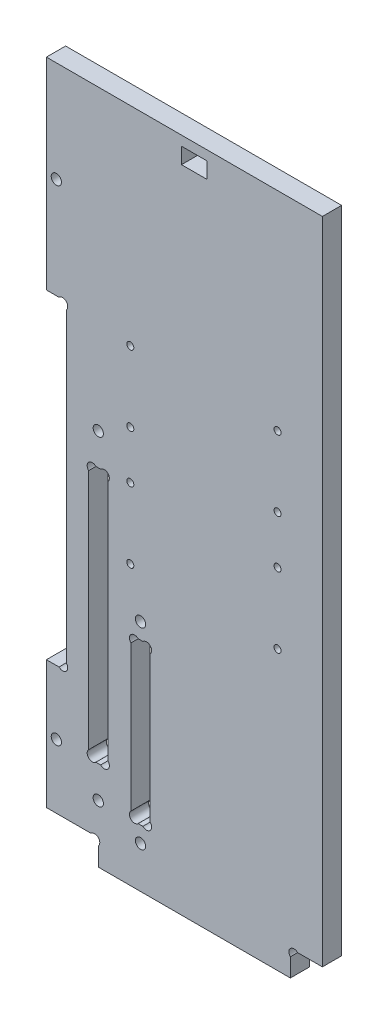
ISO-10303-21;
HEADER;
FILE_DESCRIPTION(('STEP AP214'),'2;1');
FILE_NAME('part.step','',(''),(''),'','','');
FILE_SCHEMA(('AUTOMOTIVE_DESIGN { 1 0 10303 214 1 1 1 1 }'));
ENDSEC;
DATA;
#1=APPLICATION_CONTEXT('core data for automotive mechanical design processes');
#2=APPLICATION_PROTOCOL_DEFINITION('international standard','automotive_design',2000,#1);
#3=PRODUCT_CONTEXT('',#1,'mechanical');
#4=PRODUCT('Part','Part','',(#3));
#5=PRODUCT_RELATED_PRODUCT_CATEGORY('part','',(#4));
#6=PRODUCT_DEFINITION_FORMATION('','',#4);
#7=PRODUCT_DEFINITION_CONTEXT('part definition',#1,'design');
#8=PRODUCT_DEFINITION('design','',#6,#7);
#9=PRODUCT_DEFINITION_SHAPE('','',#8);
#10=(LENGTH_UNIT() NAMED_UNIT(*) SI_UNIT(.MILLI.,.METRE.));
#11=(NAMED_UNIT(*) PLANE_ANGLE_UNIT() SI_UNIT($,.RADIAN.));
#12=(NAMED_UNIT(*) SI_UNIT($,.STERADIAN.) SOLID_ANGLE_UNIT());
#13=UNCERTAINTY_MEASURE_WITH_UNIT(LENGTH_MEASURE(1.E-05),#10,'distance_accuracy_value','');
#14=(GEOMETRIC_REPRESENTATION_CONTEXT(3) GLOBAL_UNCERTAINTY_ASSIGNED_CONTEXT((#13)) GLOBAL_UNIT_ASSIGNED_CONTEXT((#10,
#11,#12)) REPRESENTATION_CONTEXT('',''));
#15=CARTESIAN_POINT('',(0.,0.,0.));
#16=DIRECTION('',(0.,0.,1.));
#17=DIRECTION('',(1.,0.,0.));
#18=AXIS2_PLACEMENT_3D('',#15,#16,#17);
#19=CARTESIAN_POINT('',(5.06862915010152,51.1313708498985,6.));
#20=DIRECTION('',(0.,0.,1.));
#21=DIRECTION('',(1.,0.,0.));
#22=AXIS2_PLACEMENT_3D('',#19,#20,#21);
#23=PLANE('',#22);
#24=CARTESIAN_POINT('',(26.2,126.,6.));
#25=DIRECTION('',(0.,0.,1.));
#26=DIRECTION('',(-1.,0.,0.));
#27=AXIS2_PLACEMENT_3D('',#24,#25,#26);
#28=CIRCLE('',#27,1.1);
#29=CARTESIAN_POINT('',(25.1,126.,6.));
#30=VERTEX_POINT('',#29);
#31=EDGE_CURVE('E1127',#30,#30,#28,.T.);
#32=ORIENTED_EDGE('',*,*,#31,.F.);
#33=EDGE_LOOP('',(#32));
#34=FACE_BOUND('',#33,.T.);
#35=CARTESIAN_POINT('',(26.2,89.,6.));
#36=DIRECTION('',(0.,0.,1.));
#37=DIRECTION('',(-1.,0.,0.));
#38=AXIS2_PLACEMENT_3D('',#35,#36,#37);
#39=CIRCLE('',#38,1.10000000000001);
#40=CARTESIAN_POINT('',(25.1,89.,6.));
#41=VERTEX_POINT('',#40);
#42=EDGE_CURVE('E1139',#41,#41,#39,.T.);
#43=ORIENTED_EDGE('',*,*,#42,.F.);
#44=EDGE_LOOP('',(#43));
#45=FACE_BOUND('',#44,.T.);
#46=CARTESIAN_POINT('',(72.2,111.,6.));
#47=DIRECTION('',(0.,0.,1.));
#48=DIRECTION('',(1.,0.,0.));
#49=AXIS2_PLACEMENT_3D('',#46,#47,#48);
#50=CIRCLE('',#49,1.10000000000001);
#51=CARTESIAN_POINT('',(73.3,111.,6.));
#52=VERTEX_POINT('',#51);
#53=EDGE_CURVE('E1151',#52,#52,#50,.T.);
#54=ORIENTED_EDGE('',*,*,#53,.F.);
#55=EDGE_LOOP('',(#54));
#56=FACE_BOUND('',#55,.T.);
#57=CARTESIAN_POINT('',(72.2,148.,6.));
#58=DIRECTION('',(0.,0.,1.));
#59=DIRECTION('',(1.,0.,0.));
#60=AXIS2_PLACEMENT_3D('',#57,#58,#59);
#61=CIRCLE('',#60,1.1);
#62=CARTESIAN_POINT('',(73.3,148.,6.));
#63=VERTEX_POINT('',#62);
#64=EDGE_CURVE('E1163',#63,#63,#61,.T.);
#65=ORIENTED_EDGE('',*,*,#64,.F.);
#66=EDGE_LOOP('',(#65));
#67=FACE_BOUND('',#66,.T.);
#68=DIRECTION('',(1.,0.,0.));
#69=VECTOR('',#68,1.);
#70=CARTESIAN_POINT('',(42.2,205.,6.));
#71=LINE('',#70,#69);
#72=CARTESIAN_POINT('',(42.2,205.,6.));
#73=VERTEX_POINT('',#72);
#74=CARTESIAN_POINT('',(50.2,205.,6.));
#75=VERTEX_POINT('',#74);
#76=EDGE_CURVE('E258',#73,#75,#71,.T.);
#77=ORIENTED_EDGE('',*,*,#76,.F.);
#78=DIRECTION('',(0.,-1.,0.));
#79=VECTOR('',#78,1.);
#80=CARTESIAN_POINT('',(42.2,210.,6.));
#81=LINE('',#80,#79);
#82=CARTESIAN_POINT('',(42.2,210.,6.));
#83=VERTEX_POINT('',#82);
#84=EDGE_CURVE('E250',#83,#73,#81,.T.);
#85=ORIENTED_EDGE('',*,*,#84,.F.);
#86=DIRECTION('',(-1.,0.,0.));
#87=VECTOR('',#86,1.);
#88=CARTESIAN_POINT('',(42.2,210.,6.));
#89=LINE('',#88,#87);
#90=CARTESIAN_POINT('',(50.2,210.,6.));
#91=VERTEX_POINT('',#90);
#92=EDGE_CURVE('E273',#91,#83,#89,.T.);
#93=ORIENTED_EDGE('',*,*,#92,.F.);
#94=DIRECTION('',(0.,1.,0.));
#95=VECTOR('',#94,1.);
#96=CARTESIAN_POINT('',(50.2,210.,6.));
#97=LINE('',#96,#95);
#98=EDGE_CURVE('E271',#75,#91,#97,.T.);
#99=ORIENTED_EDGE('',*,*,#98,.F.);
#100=EDGE_LOOP('',(#77,#85,#93,#99));
#101=FACE_BOUND('',#100,.T.);
#102=CARTESIAN_POINT('',(29.4,75.,6.));
#103=DIRECTION('',(0.,0.,1.));
#104=DIRECTION('',(-1.,0.,0.));
#105=AXIS2_PLACEMENT_3D('',#102,#103,#104);
#106=CIRCLE('',#105,1.60000000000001);
#107=CARTESIAN_POINT('',(27.8,75.,6.));
#108=VERTEX_POINT('',#107);
#109=EDGE_CURVE('E295',#108,#108,#106,.T.);
#110=ORIENTED_EDGE('',*,*,#109,.F.);
#111=EDGE_LOOP('',(#110));
#112=FACE_BOUND('',#111,.T.);
#113=CARTESIAN_POINT('',(29.4,15.,6.));
#114=DIRECTION('',(0.,0.,1.));
#115=DIRECTION('',(1.,0.,0.));
#116=AXIS2_PLACEMENT_3D('',#113,#114,#115);
#117=CIRCLE('',#116,1.6);
#118=CARTESIAN_POINT('',(31.,15.,6.));
#119=VERTEX_POINT('',#118);
#120=EDGE_CURVE('E307',#119,#119,#117,.T.);
#121=ORIENTED_EDGE('',*,*,#120,.F.);
#122=EDGE_LOOP('',(#121));
#123=FACE_BOUND('',#122,.T.);
#124=DIRECTION('',(1.,0.,0.));
#125=VECTOR('',#124,1.);
#126=CARTESIAN_POINT('',(30.1372583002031,20.,6.));
#127=LINE('',#126,#125);
#128=CARTESIAN_POINT('',(28.6627416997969,20.,6.));
#129=VERTEX_POINT('',#128);
#130=CARTESIAN_POINT('',(30.1372583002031,20.,6.));
#131=VERTEX_POINT('',#130);
#132=EDGE_CURVE('E374',#129,#131,#127,.T.);
#133=ORIENTED_EDGE('',*,*,#132,.F.);
#134=CARTESIAN_POINT('',(27.5313708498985,21.1313708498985,6.));
#135=DIRECTION('',(0.,0.,1.));
#136=DIRECTION('',(1.,0.,0.));
#137=AXIS2_PLACEMENT_3D('',#134,#135,#136);
#138=CIRCLE('',#137,1.59999999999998);
#139=CARTESIAN_POINT('',(26.4,22.2627416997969,6.));
#140=VERTEX_POINT('',#139);
#141=EDGE_CURVE('E372',#140,#129,#138,.T.);
#142=ORIENTED_EDGE('',*,*,#141,.F.);
#143=DIRECTION('',(0.,-1.,0.));
#144=VECTOR('',#143,1.);
#145=CARTESIAN_POINT('',(26.4,22.2627416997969,6.));
#146=LINE('',#145,#144);
#147=CARTESIAN_POINT('',(26.4,67.7372583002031,6.));
#148=VERTEX_POINT('',#147);
#149=EDGE_CURVE('E388',#148,#140,#146,.T.);
#150=ORIENTED_EDGE('',*,*,#149,.F.);
#151=CARTESIAN_POINT('',(27.5313708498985,68.8686291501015,6.));
#152=DIRECTION('',(0.,0.,1.));
#153=DIRECTION('',(-1.,0.,0.));
#154=AXIS2_PLACEMENT_3D('',#151,#152,#153);
#155=CIRCLE('',#154,1.59999999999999);
#156=CARTESIAN_POINT('',(28.6627416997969,70.,6.));
#157=VERTEX_POINT('',#156);
#158=EDGE_CURVE('E385',#157,#148,#155,.T.);
#159=ORIENTED_EDGE('',*,*,#158,.F.);
#160=DIRECTION('',(-1.,0.,0.));
#161=VECTOR('',#160,1.);
#162=CARTESIAN_POINT('',(28.6627416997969,70.,6.));
#163=LINE('',#162,#161);
#164=CARTESIAN_POINT('',(30.1372583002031,70.,6.));
#165=VERTEX_POINT('',#164);
#166=EDGE_CURVE('E383',#165,#157,#163,.T.);
#167=ORIENTED_EDGE('',*,*,#166,.F.);
#168=CARTESIAN_POINT('',(31.2686291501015,68.8686291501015,6.));
#169=DIRECTION('',(0.,0.,1.));
#170=DIRECTION('',(1.,0.,0.));
#171=AXIS2_PLACEMENT_3D('',#168,#169,#170);
#172=CIRCLE('',#171,1.59999999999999);
#173=CARTESIAN_POINT('',(32.4,67.7372583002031,6.));
#174=VERTEX_POINT('',#173);
#175=EDGE_CURVE('E381',#174,#165,#172,.T.);
#176=ORIENTED_EDGE('',*,*,#175,.F.);
#177=DIRECTION('',(0.,1.,0.));
#178=VECTOR('',#177,1.);
#179=CARTESIAN_POINT('',(32.4,67.7372583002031,6.));
#180=LINE('',#179,#178);
#181=CARTESIAN_POINT('',(32.4,22.2627416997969,6.));
#182=VERTEX_POINT('',#181);
#183=EDGE_CURVE('E379',#182,#174,#180,.T.);
#184=ORIENTED_EDGE('',*,*,#183,.F.);
#185=CARTESIAN_POINT('',(31.2686291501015,21.1313708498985,6.));
#186=DIRECTION('',(0.,0.,1.));
#187=DIRECTION('',(-1.,0.,0.));
#188=AXIS2_PLACEMENT_3D('',#185,#186,#187);
#189=CIRCLE('',#188,1.59999999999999);
#190=EDGE_CURVE('E377',#131,#182,#189,.T.);
#191=ORIENTED_EDGE('',*,*,#190,.F.);
#192=EDGE_LOOP('',(#133,#142,#150,#159,#167,#176,#184,#191));
#193=FACE_BOUND('',#192,.T.);
#194=CARTESIAN_POINT('',(5.06862915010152,51.1313708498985,6.));
#195=DIRECTION('',(0.,0.,-1.));
#196=DIRECTION('',(1.,0.,0.));
#197=AXIS2_PLACEMENT_3D('',#194,#195,#196);
#198=CIRCLE('',#197,1.6);
#199=CARTESIAN_POINT('',(6.20000000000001,52.2627416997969,6.));
#200=VERTEX_POINT('',#199);
#201=CARTESIAN_POINT('',(3.93725830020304,50.,6.));
#202=VERTEX_POINT('',#201);
#203=EDGE_CURVE('E437',#200,#202,#198,.T.);
#204=ORIENTED_EDGE('',*,*,#203,.T.);
#205=DIRECTION('',(-1.,0.,0.));
#206=VECTOR('',#205,1.);
#207=CARTESIAN_POINT('',(3.93725830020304,50.,6.));
#208=LINE('',#207,#206);
#209=CARTESIAN_POINT('',(0.,50.,6.));
#210=VERTEX_POINT('',#209);
#211=EDGE_CURVE('E440',#202,#210,#208,.T.);
#212=ORIENTED_EDGE('',*,*,#211,.T.);
#213=DIRECTION('',(0.,-1.,0.));
#214=VECTOR('',#213,1.);
#215=CARTESIAN_POINT('',(0.,50.,6.));
#216=LINE('',#215,#214);
#217=CARTESIAN_POINT('',(0.,10.,6.));
#218=VERTEX_POINT('',#217);
#219=EDGE_CURVE('E443',#210,#218,#216,.T.);
#220=ORIENTED_EDGE('',*,*,#219,.T.);
#221=DIRECTION('',(1.,0.,0.));
#222=VECTOR('',#221,1.);
#223=CARTESIAN_POINT('',(0.,10.,6.));
#224=LINE('',#223,#222);
#225=CARTESIAN_POINT('',(13.937258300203,10.,6.));
#226=VERTEX_POINT('',#225);
#227=EDGE_CURVE('E445',#218,#226,#224,.T.);
#228=ORIENTED_EDGE('',*,*,#227,.T.);
#229=CARTESIAN_POINT('',(15.0686291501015,8.86862915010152,6.));
#230=DIRECTION('',(0.,0.,-1.));
#231=DIRECTION('',(-1.,0.,0.));
#232=AXIS2_PLACEMENT_3D('',#229,#230,#231);
#233=CIRCLE('',#232,1.6);
#234=CARTESIAN_POINT('',(16.2,7.73725830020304,6.));
#235=VERTEX_POINT('',#234);
#236=EDGE_CURVE('E447',#226,#235,#233,.T.);
#237=ORIENTED_EDGE('',*,*,#236,.T.);
#238=DIRECTION('',(0.,-1.,0.));
#239=VECTOR('',#238,1.);
#240=CARTESIAN_POINT('',(16.2,7.73725830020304,6.));
#241=LINE('',#240,#239);
#242=CARTESIAN_POINT('',(16.2,2.,6.));
#243=VERTEX_POINT('',#242);
#244=EDGE_CURVE('E449',#235,#243,#241,.T.);
#245=ORIENTED_EDGE('',*,*,#244,.T.);
#246=DIRECTION('',(1.,0.,0.));
#247=VECTOR('',#246,1.);
#248=CARTESIAN_POINT('',(16.2,2.,6.));
#249=LINE('',#248,#247);
#250=CARTESIAN_POINT('',(76.2,2.,6.));
#251=VERTEX_POINT('',#250);
#252=EDGE_CURVE('E451',#243,#251,#249,.T.);
#253=ORIENTED_EDGE('',*,*,#252,.T.);
#254=DIRECTION('',(0.,1.,0.));
#255=VECTOR('',#254,1.);
#256=CARTESIAN_POINT('',(76.2,2.,6.));
#257=LINE('',#256,#255);
#258=CARTESIAN_POINT('',(76.2,7.73725830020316,6.));
#259=VERTEX_POINT('',#258);
#260=EDGE_CURVE('E453',#251,#259,#257,.T.);
#261=ORIENTED_EDGE('',*,*,#260,.T.);
#262=CARTESIAN_POINT('',(77.3313708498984,8.8686291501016,6.));
#263=DIRECTION('',(0.,0.,-1.));
#264=DIRECTION('',(1.,0.,0.));
#265=AXIS2_PLACEMENT_3D('',#262,#263,#264);
#266=CIRCLE('',#265,1.59999999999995);
#267=CARTESIAN_POINT('',(78.462741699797,10.,6.));
#268=VERTEX_POINT('',#267);
#269=EDGE_CURVE('E455',#259,#268,#266,.T.);
#270=ORIENTED_EDGE('',*,*,#269,.T.);
#271=DIRECTION('',(1.,0.,0.));
#272=VECTOR('',#271,1.);
#273=CARTESIAN_POINT('',(78.462741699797,10.,6.));
#274=LINE('',#273,#272);
#275=CARTESIAN_POINT('',(86.2,10.,6.));
#276=VERTEX_POINT('',#275);
#277=EDGE_CURVE('E457',#268,#276,#274,.T.);
#278=ORIENTED_EDGE('',*,*,#277,.T.);
#279=DIRECTION('',(0.,1.,0.));
#280=VECTOR('',#279,1.);
#281=CARTESIAN_POINT('',(86.2,10.,6.));
#282=LINE('',#281,#280);
#283=CARTESIAN_POINT('',(86.2,213.,6.));
#284=VERTEX_POINT('',#283);
#285=EDGE_CURVE('E459',#276,#284,#282,.T.);
#286=ORIENTED_EDGE('',*,*,#285,.T.);
#287=DIRECTION('',(-1.,0.,0.));
#288=VECTOR('',#287,1.);
#289=CARTESIAN_POINT('',(0.,213.,6.));
#290=LINE('',#289,#288);
#291=CARTESIAN_POINT('',(0.,213.,6.));
#292=VERTEX_POINT('',#291);
#293=EDGE_CURVE('E461',#284,#292,#290,.T.);
#294=ORIENTED_EDGE('',*,*,#293,.T.);
#295=DIRECTION('',(0.,-1.,0.));
#296=VECTOR('',#295,1.);
#297=CARTESIAN_POINT('',(0.,150.,6.));
#298=LINE('',#297,#296);
#299=CARTESIAN_POINT('',(0.,150.,6.));
#300=VERTEX_POINT('',#299);
#301=EDGE_CURVE('E463',#292,#300,#298,.T.);
#302=ORIENTED_EDGE('',*,*,#301,.T.);
#303=DIRECTION('',(1.,0.,0.));
#304=VECTOR('',#303,1.);
#305=CARTESIAN_POINT('',(3.93725830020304,150.,6.));
#306=LINE('',#305,#304);
#307=CARTESIAN_POINT('',(3.93725830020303,150.,6.));
#308=VERTEX_POINT('',#307);
#309=EDGE_CURVE('E465',#300,#308,#306,.T.);
#310=ORIENTED_EDGE('',*,*,#309,.T.);
#311=CARTESIAN_POINT('',(5.06862915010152,148.868629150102,6.));
#312=DIRECTION('',(0.,0.,-1.));
#313=DIRECTION('',(-1.,0.,0.));
#314=AXIS2_PLACEMENT_3D('',#311,#312,#313);
#315=CIRCLE('',#314,1.59999999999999);
#316=CARTESIAN_POINT('',(6.2,147.737258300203,6.));
#317=VERTEX_POINT('',#316);
#318=EDGE_CURVE('E467',#308,#317,#315,.T.);
#319=ORIENTED_EDGE('',*,*,#318,.T.);
#320=DIRECTION('',(0.,-1.,0.));
#321=VECTOR('',#320,1.);
#322=CARTESIAN_POINT('',(6.2,147.737258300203,6.));
#323=LINE('',#322,#321);
#324=EDGE_CURVE('E469',#317,#200,#323,.T.);
#325=ORIENTED_EDGE('',*,*,#324,.T.);
#326=EDGE_LOOP('',(#204,#212,#220,#228,#237,#245,#253,#261,#270,#278,#286,#294,#302,#310,#319,#325));
#327=FACE_BOUND('',#326,.T.);
#328=CARTESIAN_POINT('',(3.1,30.,6.));
#329=DIRECTION('',(0.,0.,1.));
#330=DIRECTION('',(1.,0.,0.));
#331=AXIS2_PLACEMENT_3D('',#328,#329,#330);
#332=CIRCLE('',#331,1.6);
#333=CARTESIAN_POINT('',(4.7,30.,6.));
#334=VERTEX_POINT('',#333);
#335=EDGE_CURVE('E431',#334,#334,#332,.T.);
#336=ORIENTED_EDGE('',*,*,#335,.F.);
#337=EDGE_LOOP('',(#336));
#338=FACE_BOUND('',#337,.T.);
#339=DIRECTION('',(1.,0.,0.));
#340=VECTOR('',#339,1.);
#341=CARTESIAN_POINT('',(15.4627416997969,30.,6.));
#342=LINE('',#341,#340);
#343=CARTESIAN_POINT('',(15.4627416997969,30.,6.));
#344=VERTEX_POINT('',#343);
#345=CARTESIAN_POINT('',(16.937258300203,30.,6.));
#346=VERTEX_POINT('',#345);
#347=EDGE_CURVE('E315',#344,#346,#342,.T.);
#348=ORIENTED_EDGE('',*,*,#347,.F.);
#349=CARTESIAN_POINT('',(14.3313708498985,31.1313708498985,6.));
#350=DIRECTION('',(0.,0.,1.));
#351=DIRECTION('',(1.,0.,0.));
#352=AXIS2_PLACEMENT_3D('',#349,#350,#351);
#353=CIRCLE('',#352,1.59999999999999);
#354=CARTESIAN_POINT('',(13.2,32.2627416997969,6.));
#355=VERTEX_POINT('',#354);
#356=EDGE_CURVE('E313',#355,#344,#353,.T.);
#357=ORIENTED_EDGE('',*,*,#356,.F.);
#358=DIRECTION('',(0.,-1.,0.));
#359=VECTOR('',#358,1.);
#360=CARTESIAN_POINT('',(13.2,107.737258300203,6.));
#361=LINE('',#360,#359);
#362=CARTESIAN_POINT('',(13.2,107.737258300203,6.));
#363=VERTEX_POINT('',#362);
#364=EDGE_CURVE('E329',#363,#355,#361,.T.);
#365=ORIENTED_EDGE('',*,*,#364,.F.);
#366=CARTESIAN_POINT('',(14.3313708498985,108.868629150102,6.));
#367=DIRECTION('',(0.,0.,1.));
#368=DIRECTION('',(-1.,0.,0.));
#369=AXIS2_PLACEMENT_3D('',#366,#367,#368);
#370=CIRCLE('',#369,1.59999999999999);
#371=CARTESIAN_POINT('',(15.462741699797,110.,6.));
#372=VERTEX_POINT('',#371);
#373=EDGE_CURVE('E326',#372,#363,#370,.T.);
#374=ORIENTED_EDGE('',*,*,#373,.F.);
#375=DIRECTION('',(-1.,0.,0.));
#376=VECTOR('',#375,1.);
#377=CARTESIAN_POINT('',(15.462741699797,110.,6.));
#378=LINE('',#377,#376);
#379=CARTESIAN_POINT('',(16.937258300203,110.,6.));
#380=VERTEX_POINT('',#379);
#381=EDGE_CURVE('E324',#380,#372,#378,.T.);
#382=ORIENTED_EDGE('',*,*,#381,.F.);
#383=CARTESIAN_POINT('',(18.0686291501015,108.868629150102,6.));
#384=DIRECTION('',(0.,0.,1.));
#385=DIRECTION('',(1.,0.,0.));
#386=AXIS2_PLACEMENT_3D('',#383,#384,#385);
#387=CIRCLE('',#386,1.59999999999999);
#388=CARTESIAN_POINT('',(19.2,107.737258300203,6.));
#389=VERTEX_POINT('',#388);
#390=EDGE_CURVE('E322',#389,#380,#387,.T.);
#391=ORIENTED_EDGE('',*,*,#390,.F.);
#392=DIRECTION('',(0.,1.,0.));
#393=VECTOR('',#392,1.);
#394=CARTESIAN_POINT('',(19.2,107.737258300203,6.));
#395=LINE('',#394,#393);
#396=CARTESIAN_POINT('',(19.2,32.2627416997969,6.));
#397=VERTEX_POINT('',#396);
#398=EDGE_CURVE('E320',#397,#389,#395,.T.);
#399=ORIENTED_EDGE('',*,*,#398,.F.);
#400=CARTESIAN_POINT('',(18.0686291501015,31.1313708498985,6.));
#401=DIRECTION('',(0.,0.,1.));
#402=DIRECTION('',(-1.,0.,0.));
#403=AXIS2_PLACEMENT_3D('',#400,#401,#402);
#404=CIRCLE('',#403,1.59999999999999);
#405=EDGE_CURVE('E318',#346,#397,#404,.T.);
#406=ORIENTED_EDGE('',*,*,#405,.F.);
#407=EDGE_LOOP('',(#348,#357,#365,#374,#382,#391,#399,#406));
#408=FACE_BOUND('',#407,.T.);
#409=CARTESIAN_POINT('',(16.2,20.,6.));
#410=DIRECTION('',(0.,0.,1.));
#411=DIRECTION('',(1.,0.,0.));
#412=AXIS2_PLACEMENT_3D('',#409,#410,#411);
#413=CIRCLE('',#412,1.6);
#414=CARTESIAN_POINT('',(17.8,20.,6.));
#415=VERTEX_POINT('',#414);
#416=EDGE_CURVE('E301',#415,#415,#413,.T.);
#417=ORIENTED_EDGE('',*,*,#416,.F.);
#418=EDGE_LOOP('',(#417));
#419=FACE_BOUND('',#418,.T.);
#420=CARTESIAN_POINT('',(16.2,120.,6.));
#421=DIRECTION('',(0.,0.,1.));
#422=DIRECTION('',(-1.,0.,0.));
#423=AXIS2_PLACEMENT_3D('',#420,#421,#422);
#424=CIRCLE('',#423,1.60000000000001);
#425=CARTESIAN_POINT('',(14.6,120.,6.));
#426=VERTEX_POINT('',#425);
#427=EDGE_CURVE('E289',#426,#426,#424,.T.);
#428=ORIENTED_EDGE('',*,*,#427,.F.);
#429=EDGE_LOOP('',(#428));
#430=FACE_BOUND('',#429,.T.);
#431=CARTESIAN_POINT('',(3.1,181.5,6.));
#432=DIRECTION('',(0.,0.,1.));
#433=DIRECTION('',(1.,0.,0.));
#434=AXIS2_PLACEMENT_3D('',#431,#432,#433);
#435=CIRCLE('',#434,1.6);
#436=CARTESIAN_POINT('',(4.7,181.5,6.));
#437=VERTEX_POINT('',#436);
#438=EDGE_CURVE('E279',#437,#437,#435,.T.);
#439=ORIENTED_EDGE('',*,*,#438,.F.);
#440=EDGE_LOOP('',(#439));
#441=FACE_BOUND('',#440,.T.);
#442=CARTESIAN_POINT('',(72.2,126.,6.));
#443=DIRECTION('',(0.,0.,1.));
#444=DIRECTION('',(1.,0.,0.));
#445=AXIS2_PLACEMENT_3D('',#442,#443,#444);
#446=CIRCLE('',#445,1.1);
#447=CARTESIAN_POINT('',(73.3,126.,6.));
#448=VERTEX_POINT('',#447);
#449=EDGE_CURVE('E1157',#448,#448,#446,.T.);
#450=ORIENTED_EDGE('',*,*,#449,.F.);
#451=EDGE_LOOP('',(#450));
#452=FACE_BOUND('',#451,.T.);
#453=CARTESIAN_POINT('',(72.2,89.,6.));
#454=DIRECTION('',(0.,0.,1.));
#455=DIRECTION('',(1.,0.,0.));
#456=AXIS2_PLACEMENT_3D('',#453,#454,#455);
#457=CIRCLE('',#456,1.10000000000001);
#458=CARTESIAN_POINT('',(73.3,89.,6.));
#459=VERTEX_POINT('',#458);
#460=EDGE_CURVE('E1145',#459,#459,#457,.T.);
#461=ORIENTED_EDGE('',*,*,#460,.F.);
#462=EDGE_LOOP('',(#461));
#463=FACE_BOUND('',#462,.T.);
#464=CARTESIAN_POINT('',(26.2,111.,6.));
#465=DIRECTION('',(0.,0.,1.));
#466=DIRECTION('',(-1.,0.,0.));
#467=AXIS2_PLACEMENT_3D('',#464,#465,#466);
#468=CIRCLE('',#467,1.10000000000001);
#469=CARTESIAN_POINT('',(25.1,111.,6.));
#470=VERTEX_POINT('',#469);
#471=EDGE_CURVE('E1133',#470,#470,#468,.T.);
#472=ORIENTED_EDGE('',*,*,#471,.F.);
#473=EDGE_LOOP('',(#472));
#474=FACE_BOUND('',#473,.T.);
#475=CARTESIAN_POINT('',(26.2,148.,6.));
#476=DIRECTION('',(0.,0.,1.));
#477=DIRECTION('',(-1.,0.,0.));
#478=AXIS2_PLACEMENT_3D('',#475,#476,#477);
#479=CIRCLE('',#478,1.1);
#480=CARTESIAN_POINT('',(25.1,148.,6.));
#481=VERTEX_POINT('',#480);
#482=EDGE_CURVE('E1118',#481,#481,#479,.T.);
#483=ORIENTED_EDGE('',*,*,#482,.F.);
#484=EDGE_LOOP('',(#483));
#485=FACE_BOUND('',#484,.T.);
#486=ADVANCED_FACE('F17',(#34,#45,#56,#67,#101,#112,#123,#193,#327,#338,#408,#419,#430,#441,
#452,#463,#474,#485),#23,.T.);
#487=CARTESIAN_POINT('',(5.06862915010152,51.1313708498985,0.));
#488=DIRECTION('',(0.,0.,1.));
#489=DIRECTION('',(1.,0.,0.));
#490=AXIS2_PLACEMENT_3D('',#487,#488,#489);
#491=PLANE('',#490);
#492=CARTESIAN_POINT('',(26.2,126.,0.));
#493=DIRECTION('',(0.,0.,1.));
#494=DIRECTION('',(-1.,0.,0.));
#495=AXIS2_PLACEMENT_3D('',#492,#493,#494);
#496=CIRCLE('',#495,1.1);
#497=CARTESIAN_POINT('',(25.1,126.,0.));
#498=VERTEX_POINT('',#497);
#499=EDGE_CURVE('E1124',#498,#498,#496,.T.);
#500=ORIENTED_EDGE('',*,*,#499,.T.);
#501=EDGE_LOOP('',(#500));
#502=FACE_BOUND('',#501,.T.);
#503=CARTESIAN_POINT('',(26.2,89.,0.));
#504=DIRECTION('',(0.,0.,1.));
#505=DIRECTION('',(-1.,0.,0.));
#506=AXIS2_PLACEMENT_3D('',#503,#504,#505);
#507=CIRCLE('',#506,1.10000000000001);
#508=CARTESIAN_POINT('',(25.1,89.,0.));
#509=VERTEX_POINT('',#508);
#510=EDGE_CURVE('E1136',#509,#509,#507,.T.);
#511=ORIENTED_EDGE('',*,*,#510,.T.);
#512=EDGE_LOOP('',(#511));
#513=FACE_BOUND('',#512,.T.);
#514=CARTESIAN_POINT('',(72.2,111.,0.));
#515=DIRECTION('',(0.,0.,1.));
#516=DIRECTION('',(1.,0.,0.));
#517=AXIS2_PLACEMENT_3D('',#514,#515,#516);
#518=CIRCLE('',#517,1.10000000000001);
#519=CARTESIAN_POINT('',(73.3,111.,0.));
#520=VERTEX_POINT('',#519);
#521=EDGE_CURVE('E1148',#520,#520,#518,.T.);
#522=ORIENTED_EDGE('',*,*,#521,.T.);
#523=EDGE_LOOP('',(#522));
#524=FACE_BOUND('',#523,.T.);
#525=CARTESIAN_POINT('',(72.2,148.,0.));
#526=DIRECTION('',(0.,0.,1.));
#527=DIRECTION('',(1.,0.,0.));
#528=AXIS2_PLACEMENT_3D('',#525,#526,#527);
#529=CIRCLE('',#528,1.1);
#530=CARTESIAN_POINT('',(73.3,148.,0.));
#531=VERTEX_POINT('',#530);
#532=EDGE_CURVE('E1160',#531,#531,#529,.T.);
#533=ORIENTED_EDGE('',*,*,#532,.T.);
#534=EDGE_LOOP('',(#533));
#535=FACE_BOUND('',#534,.T.);
#536=DIRECTION('',(0.,-1.,0.));
#537=VECTOR('',#536,1.);
#538=CARTESIAN_POINT('',(42.2,210.,0.));
#539=LINE('',#538,#537);
#540=CARTESIAN_POINT('',(42.2,210.,0.));
#541=VERTEX_POINT('',#540);
#542=CARTESIAN_POINT('',(42.2,205.,0.));
#543=VERTEX_POINT('',#542);
#544=EDGE_CURVE('E40',#541,#543,#539,.T.);
#545=ORIENTED_EDGE('',*,*,#544,.T.);
#546=DIRECTION('',(1.,0.,0.));
#547=VECTOR('',#546,1.);
#548=CARTESIAN_POINT('',(42.2,205.,0.));
#549=LINE('',#548,#547);
#550=CARTESIAN_POINT('',(50.2,205.,0.));
#551=VERTEX_POINT('',#550);
#552=EDGE_CURVE('E265',#543,#551,#549,.T.);
#553=ORIENTED_EDGE('',*,*,#552,.T.);
#554=DIRECTION('',(0.,1.,0.));
#555=VECTOR('',#554,1.);
#556=CARTESIAN_POINT('',(50.2,210.,0.));
#557=LINE('',#556,#555);
#558=CARTESIAN_POINT('',(50.2,210.,0.));
#559=VERTEX_POINT('',#558);
#560=EDGE_CURVE('E281',#551,#559,#557,.T.);
#561=ORIENTED_EDGE('',*,*,#560,.T.);
#562=DIRECTION('',(-1.,0.,0.));
#563=VECTOR('',#562,1.);
#564=CARTESIAN_POINT('',(42.2,210.,0.));
#565=LINE('',#564,#563);
#566=EDGE_CURVE('E259',#559,#541,#565,.T.);
#567=ORIENTED_EDGE('',*,*,#566,.T.);
#568=EDGE_LOOP('',(#545,#553,#561,#567));
#569=FACE_BOUND('',#568,.T.);
#570=CARTESIAN_POINT('',(29.4,75.,0.));
#571=DIRECTION('',(0.,0.,1.));
#572=DIRECTION('',(-1.,0.,0.));
#573=AXIS2_PLACEMENT_3D('',#570,#571,#572);
#574=CIRCLE('',#573,1.60000000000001);
#575=CARTESIAN_POINT('',(27.8,75.,0.));
#576=VERTEX_POINT('',#575);
#577=EDGE_CURVE('E292',#576,#576,#574,.T.);
#578=ORIENTED_EDGE('',*,*,#577,.T.);
#579=EDGE_LOOP('',(#578));
#580=FACE_BOUND('',#579,.T.);
#581=CARTESIAN_POINT('',(29.4,15.,0.));
#582=DIRECTION('',(0.,0.,1.));
#583=DIRECTION('',(1.,0.,0.));
#584=AXIS2_PLACEMENT_3D('',#581,#582,#583);
#585=CIRCLE('',#584,1.6);
#586=CARTESIAN_POINT('',(31.,15.,0.));
#587=VERTEX_POINT('',#586);
#588=EDGE_CURVE('E304',#587,#587,#585,.T.);
#589=ORIENTED_EDGE('',*,*,#588,.T.);
#590=EDGE_LOOP('',(#589));
#591=FACE_BOUND('',#590,.T.);
#592=CARTESIAN_POINT('',(27.5313708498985,21.1313708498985,0.));
#593=DIRECTION('',(0.,0.,1.));
#594=DIRECTION('',(1.,0.,0.));
#595=AXIS2_PLACEMENT_3D('',#592,#593,#594);
#596=CIRCLE('',#595,1.59999999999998);
#597=CARTESIAN_POINT('',(26.4,22.2627416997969,0.));
#598=VERTEX_POINT('',#597);
#599=CARTESIAN_POINT('',(28.6627416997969,20.,0.));
#600=VERTEX_POINT('',#599);
#601=EDGE_CURVE('E371',#598,#600,#596,.T.);
#602=ORIENTED_EDGE('',*,*,#601,.T.);
#603=DIRECTION('',(1.,0.,0.));
#604=VECTOR('',#603,1.);
#605=CARTESIAN_POINT('',(30.1372583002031,20.,0.));
#606=LINE('',#605,#604);
#607=CARTESIAN_POINT('',(30.1372583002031,20.,0.));
#608=VERTEX_POINT('',#607);
#609=EDGE_CURVE('E393',#600,#608,#606,.T.);
#610=ORIENTED_EDGE('',*,*,#609,.T.);
#611=CARTESIAN_POINT('',(31.2686291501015,21.1313708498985,0.));
#612=DIRECTION('',(0.,0.,1.));
#613=DIRECTION('',(-1.,0.,0.));
#614=AXIS2_PLACEMENT_3D('',#611,#612,#613);
#615=CIRCLE('',#614,1.59999999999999);
#616=CARTESIAN_POINT('',(32.4,22.2627416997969,0.));
#617=VERTEX_POINT('',#616);
#618=EDGE_CURVE('E396',#608,#617,#615,.T.);
#619=ORIENTED_EDGE('',*,*,#618,.T.);
#620=DIRECTION('',(0.,1.,0.));
#621=VECTOR('',#620,1.);
#622=CARTESIAN_POINT('',(32.4,67.7372583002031,0.));
#623=LINE('',#622,#621);
#624=CARTESIAN_POINT('',(32.4,67.7372583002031,0.));
#625=VERTEX_POINT('',#624);
#626=EDGE_CURVE('E399',#617,#625,#623,.T.);
#627=ORIENTED_EDGE('',*,*,#626,.T.);
#628=CARTESIAN_POINT('',(31.2686291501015,68.8686291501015,0.));
#629=DIRECTION('',(0.,0.,1.));
#630=DIRECTION('',(1.,0.,0.));
#631=AXIS2_PLACEMENT_3D('',#628,#629,#630);
#632=CIRCLE('',#631,1.59999999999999);
#633=CARTESIAN_POINT('',(30.1372583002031,70.,0.));
#634=VERTEX_POINT('',#633);
#635=EDGE_CURVE('E402',#625,#634,#632,.T.);
#636=ORIENTED_EDGE('',*,*,#635,.T.);
#637=DIRECTION('',(-1.,0.,0.));
#638=VECTOR('',#637,1.);
#639=CARTESIAN_POINT('',(28.6627416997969,70.,0.));
#640=LINE('',#639,#638);
#641=CARTESIAN_POINT('',(28.6627416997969,70.,0.));
#642=VERTEX_POINT('',#641);
#643=EDGE_CURVE('E405',#634,#642,#640,.T.);
#644=ORIENTED_EDGE('',*,*,#643,.T.);
#645=CARTESIAN_POINT('',(27.5313708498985,68.8686291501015,0.));
#646=DIRECTION('',(0.,0.,1.));
#647=DIRECTION('',(-1.,0.,0.));
#648=AXIS2_PLACEMENT_3D('',#645,#646,#647);
#649=CIRCLE('',#648,1.59999999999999);
#650=CARTESIAN_POINT('',(26.4,67.7372583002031,0.));
#651=VERTEX_POINT('',#650);
#652=EDGE_CURVE('E408',#642,#651,#649,.T.);
#653=ORIENTED_EDGE('',*,*,#652,.T.);
#654=DIRECTION('',(0.,-1.,0.));
#655=VECTOR('',#654,1.);
#656=CARTESIAN_POINT('',(26.4,22.2627416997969,0.));
#657=LINE('',#656,#655);
#658=EDGE_CURVE('E375',#651,#598,#657,.T.);
#659=ORIENTED_EDGE('',*,*,#658,.T.);
#660=EDGE_LOOP('',(#602,#610,#619,#627,#636,#644,#653,#659));
#661=FACE_BOUND('',#660,.T.);
#662=CARTESIAN_POINT('',(5.06862915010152,51.1313708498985,0.));
#663=DIRECTION('',(0.,0.,-1.));
#664=DIRECTION('',(1.,0.,0.));
#665=AXIS2_PLACEMENT_3D('',#662,#663,#664);
#666=CIRCLE('',#665,1.6);
#667=CARTESIAN_POINT('',(6.20000000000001,52.2627416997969,0.));
#668=VERTEX_POINT('',#667);
#669=CARTESIAN_POINT('',(3.93725830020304,50.,0.));
#670=VERTEX_POINT('',#669);
#671=EDGE_CURVE('E434',#668,#670,#666,.T.);
#672=ORIENTED_EDGE('',*,*,#671,.F.);
#673=DIRECTION('',(0.,-1.,0.));
#674=VECTOR('',#673,1.);
#675=CARTESIAN_POINT('',(6.2,147.737258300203,0.));
#676=LINE('',#675,#674);
#677=CARTESIAN_POINT('',(6.2,147.737258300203,0.));
#678=VERTEX_POINT('',#677);
#679=EDGE_CURVE('E441',#678,#668,#676,.T.);
#680=ORIENTED_EDGE('',*,*,#679,.F.);
#681=CARTESIAN_POINT('',(5.06862915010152,148.868629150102,0.));
#682=DIRECTION('',(0.,0.,-1.));
#683=DIRECTION('',(-1.,0.,0.));
#684=AXIS2_PLACEMENT_3D('',#681,#682,#683);
#685=CIRCLE('',#684,1.59999999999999);
#686=CARTESIAN_POINT('',(3.93725830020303,150.,0.));
#687=VERTEX_POINT('',#686);
#688=EDGE_CURVE('E500',#687,#678,#685,.T.);
#689=ORIENTED_EDGE('',*,*,#688,.F.);
#690=DIRECTION('',(1.,0.,0.));
#691=VECTOR('',#690,1.);
#692=CARTESIAN_POINT('',(3.93725830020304,150.,0.));
#693=LINE('',#692,#691);
#694=CARTESIAN_POINT('',(0.,150.,0.));
#695=VERTEX_POINT('',#694);
#696=EDGE_CURVE('E498',#695,#687,#693,.T.);
#697=ORIENTED_EDGE('',*,*,#696,.F.);
#698=DIRECTION('',(0.,-1.,0.));
#699=VECTOR('',#698,1.);
#700=CARTESIAN_POINT('',(0.,150.,0.));
#701=LINE('',#700,#699);
#702=CARTESIAN_POINT('',(0.,213.,0.));
#703=VERTEX_POINT('',#702);
#704=EDGE_CURVE('E496',#703,#695,#701,.T.);
#705=ORIENTED_EDGE('',*,*,#704,.F.);
#706=DIRECTION('',(-1.,0.,0.));
#707=VECTOR('',#706,1.);
#708=CARTESIAN_POINT('',(0.,213.,0.));
#709=LINE('',#708,#707);
#710=CARTESIAN_POINT('',(86.2,213.,0.));
#711=VERTEX_POINT('',#710);
#712=EDGE_CURVE('E494',#711,#703,#709,.T.);
#713=ORIENTED_EDGE('',*,*,#712,.F.);
#714=DIRECTION('',(0.,1.,0.));
#715=VECTOR('',#714,1.);
#716=CARTESIAN_POINT('',(86.2,10.,0.));
#717=LINE('',#716,#715);
#718=CARTESIAN_POINT('',(86.2,10.,0.));
#719=VERTEX_POINT('',#718);
#720=EDGE_CURVE('E492',#719,#711,#717,.T.);
#721=ORIENTED_EDGE('',*,*,#720,.F.);
#722=DIRECTION('',(1.,0.,0.));
#723=VECTOR('',#722,1.);
#724=CARTESIAN_POINT('',(78.462741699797,10.,0.));
#725=LINE('',#724,#723);
#726=CARTESIAN_POINT('',(78.462741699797,10.,0.));
#727=VERTEX_POINT('',#726);
#728=EDGE_CURVE('E490',#727,#719,#725,.T.);
#729=ORIENTED_EDGE('',*,*,#728,.F.);
#730=CARTESIAN_POINT('',(77.3313708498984,8.8686291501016,0.));
#731=DIRECTION('',(0.,0.,-1.));
#732=DIRECTION('',(1.,0.,0.));
#733=AXIS2_PLACEMENT_3D('',#730,#731,#732);
#734=CIRCLE('',#733,1.59999999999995);
#735=CARTESIAN_POINT('',(76.2,7.73725830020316,0.));
#736=VERTEX_POINT('',#735);
#737=EDGE_CURVE('E488',#736,#727,#734,.T.);
#738=ORIENTED_EDGE('',*,*,#737,.F.);
#739=DIRECTION('',(0.,1.,0.));
#740=VECTOR('',#739,1.);
#741=CARTESIAN_POINT('',(76.2,2.,0.));
#742=LINE('',#741,#740);
#743=CARTESIAN_POINT('',(76.2,2.,0.));
#744=VERTEX_POINT('',#743);
#745=EDGE_CURVE('E486',#744,#736,#742,.T.);
#746=ORIENTED_EDGE('',*,*,#745,.F.);
#747=DIRECTION('',(1.,0.,0.));
#748=VECTOR('',#747,1.);
#749=CARTESIAN_POINT('',(16.2,2.,0.));
#750=LINE('',#749,#748);
#751=CARTESIAN_POINT('',(16.2,2.,0.));
#752=VERTEX_POINT('',#751);
#753=EDGE_CURVE('E484',#752,#744,#750,.T.);
#754=ORIENTED_EDGE('',*,*,#753,.F.);
#755=DIRECTION('',(0.,-1.,0.));
#756=VECTOR('',#755,1.);
#757=CARTESIAN_POINT('',(16.2,7.73725830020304,0.));
#758=LINE('',#757,#756);
#759=CARTESIAN_POINT('',(16.2,7.73725830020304,0.));
#760=VERTEX_POINT('',#759);
#761=EDGE_CURVE('E482',#760,#752,#758,.T.);
#762=ORIENTED_EDGE('',*,*,#761,.F.);
#763=CARTESIAN_POINT('',(15.0686291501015,8.86862915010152,0.));
#764=DIRECTION('',(0.,0.,-1.));
#765=DIRECTION('',(-1.,0.,0.));
#766=AXIS2_PLACEMENT_3D('',#763,#764,#765);
#767=CIRCLE('',#766,1.6);
#768=CARTESIAN_POINT('',(13.937258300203,10.,0.));
#769=VERTEX_POINT('',#768);
#770=EDGE_CURVE('E480',#769,#760,#767,.T.);
#771=ORIENTED_EDGE('',*,*,#770,.F.);
#772=DIRECTION('',(1.,0.,0.));
#773=VECTOR('',#772,1.);
#774=CARTESIAN_POINT('',(0.,10.,0.));
#775=LINE('',#774,#773);
#776=CARTESIAN_POINT('',(0.,10.,0.));
#777=VERTEX_POINT('',#776);
#778=EDGE_CURVE('E478',#777,#769,#775,.T.);
#779=ORIENTED_EDGE('',*,*,#778,.F.);
#780=DIRECTION('',(0.,-1.,0.));
#781=VECTOR('',#780,1.);
#782=CARTESIAN_POINT('',(0.,50.,0.));
#783=LINE('',#782,#781);
#784=CARTESIAN_POINT('',(0.,50.,0.));
#785=VERTEX_POINT('',#784);
#786=EDGE_CURVE('E476',#785,#777,#783,.T.);
#787=ORIENTED_EDGE('',*,*,#786,.F.);
#788=DIRECTION('',(-1.,0.,0.));
#789=VECTOR('',#788,1.);
#790=CARTESIAN_POINT('',(3.93725830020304,50.,0.));
#791=LINE('',#790,#789);
#792=EDGE_CURVE('E474',#670,#785,#791,.T.);
#793=ORIENTED_EDGE('',*,*,#792,.F.);
#794=EDGE_LOOP('',(#672,#680,#689,#697,#705,#713,#721,#729,#738,#746,#754,#762,#771,#779,#787,#793));
#795=FACE_BOUND('',#794,.T.);
#796=CARTESIAN_POINT('',(3.1,30.,0.));
#797=DIRECTION('',(0.,0.,1.));
#798=DIRECTION('',(1.,0.,0.));
#799=AXIS2_PLACEMENT_3D('',#796,#797,#798);
#800=CIRCLE('',#799,1.6);
#801=CARTESIAN_POINT('',(4.7,30.,0.));
#802=VERTEX_POINT('',#801);
#803=EDGE_CURVE('E430',#802,#802,#800,.T.);
#804=ORIENTED_EDGE('',*,*,#803,.T.);
#805=EDGE_LOOP('',(#804));
#806=FACE_BOUND('',#805,.T.);
#807=CARTESIAN_POINT('',(14.3313708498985,31.1313708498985,0.));
#808=DIRECTION('',(0.,0.,1.));
#809=DIRECTION('',(1.,0.,0.));
#810=AXIS2_PLACEMENT_3D('',#807,#808,#809);
#811=CIRCLE('',#810,1.59999999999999);
#812=CARTESIAN_POINT('',(13.2,32.2627416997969,0.));
#813=VERTEX_POINT('',#812);
#814=CARTESIAN_POINT('',(15.4627416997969,30.,0.));
#815=VERTEX_POINT('',#814);
#816=EDGE_CURVE('E310',#813,#815,#811,.T.);
#817=ORIENTED_EDGE('',*,*,#816,.T.);
#818=DIRECTION('',(1.,0.,0.));
#819=VECTOR('',#818,1.);
#820=CARTESIAN_POINT('',(15.4627416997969,30.,0.));
#821=LINE('',#820,#819);
#822=CARTESIAN_POINT('',(16.937258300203,30.,0.));
#823=VERTEX_POINT('',#822);
#824=EDGE_CURVE('E334',#815,#823,#821,.T.);
#825=ORIENTED_EDGE('',*,*,#824,.T.);
#826=CARTESIAN_POINT('',(18.0686291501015,31.1313708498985,0.));
#827=DIRECTION('',(0.,0.,1.));
#828=DIRECTION('',(-1.,0.,0.));
#829=AXIS2_PLACEMENT_3D('',#826,#827,#828);
#830=CIRCLE('',#829,1.59999999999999);
#831=CARTESIAN_POINT('',(19.2,32.2627416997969,0.));
#832=VERTEX_POINT('',#831);
#833=EDGE_CURVE('E337',#823,#832,#830,.T.);
#834=ORIENTED_EDGE('',*,*,#833,.T.);
#835=DIRECTION('',(0.,1.,0.));
#836=VECTOR('',#835,1.);
#837=CARTESIAN_POINT('',(19.2,107.737258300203,0.));
#838=LINE('',#837,#836);
#839=CARTESIAN_POINT('',(19.2,107.737258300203,0.));
#840=VERTEX_POINT('',#839);
#841=EDGE_CURVE('E340',#832,#840,#838,.T.);
#842=ORIENTED_EDGE('',*,*,#841,.T.);
#843=CARTESIAN_POINT('',(18.0686291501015,108.868629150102,0.));
#844=DIRECTION('',(0.,0.,1.));
#845=DIRECTION('',(1.,0.,0.));
#846=AXIS2_PLACEMENT_3D('',#843,#844,#845);
#847=CIRCLE('',#846,1.59999999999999);
#848=CARTESIAN_POINT('',(16.937258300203,110.,0.));
#849=VERTEX_POINT('',#848);
#850=EDGE_CURVE('E343',#840,#849,#847,.T.);
#851=ORIENTED_EDGE('',*,*,#850,.T.);
#852=DIRECTION('',(-1.,0.,0.));
#853=VECTOR('',#852,1.);
#854=CARTESIAN_POINT('',(15.462741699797,110.,0.));
#855=LINE('',#854,#853);
#856=CARTESIAN_POINT('',(15.462741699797,110.,0.));
#857=VERTEX_POINT('',#856);
#858=EDGE_CURVE('E346',#849,#857,#855,.T.);
#859=ORIENTED_EDGE('',*,*,#858,.T.);
#860=CARTESIAN_POINT('',(14.3313708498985,108.868629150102,0.));
#861=DIRECTION('',(0.,0.,1.));
#862=DIRECTION('',(-1.,0.,0.));
#863=AXIS2_PLACEMENT_3D('',#860,#861,#862);
#864=CIRCLE('',#863,1.59999999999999);
#865=CARTESIAN_POINT('',(13.2,107.737258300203,0.));
#866=VERTEX_POINT('',#865);
#867=EDGE_CURVE('E349',#857,#866,#864,.T.);
#868=ORIENTED_EDGE('',*,*,#867,.T.);
#869=DIRECTION('',(0.,-1.,0.));
#870=VECTOR('',#869,1.);
#871=CARTESIAN_POINT('',(13.2,107.737258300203,0.));
#872=LINE('',#871,#870);
#873=EDGE_CURVE('E316',#866,#813,#872,.T.);
#874=ORIENTED_EDGE('',*,*,#873,.T.);
#875=EDGE_LOOP('',(#817,#825,#834,#842,#851,#859,#868,#874));
#876=FACE_BOUND('',#875,.T.);
#877=CARTESIAN_POINT('',(16.2,20.,0.));
#878=DIRECTION('',(0.,0.,1.));
#879=DIRECTION('',(1.,0.,0.));
#880=AXIS2_PLACEMENT_3D('',#877,#878,#879);
#881=CIRCLE('',#880,1.6);
#882=CARTESIAN_POINT('',(17.8,20.,0.));
#883=VERTEX_POINT('',#882);
#884=EDGE_CURVE('E298',#883,#883,#881,.T.);
#885=ORIENTED_EDGE('',*,*,#884,.T.);
#886=EDGE_LOOP('',(#885));
#887=FACE_BOUND('',#886,.T.);
#888=CARTESIAN_POINT('',(16.2,120.,0.));
#889=DIRECTION('',(0.,0.,1.));
#890=DIRECTION('',(-1.,0.,0.));
#891=AXIS2_PLACEMENT_3D('',#888,#889,#890);
#892=CIRCLE('',#891,1.60000000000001);
#893=CARTESIAN_POINT('',(14.6,120.,0.));
#894=VERTEX_POINT('',#893);
#895=EDGE_CURVE('E266',#894,#894,#892,.T.);
#896=ORIENTED_EDGE('',*,*,#895,.T.);
#897=EDGE_LOOP('',(#896));
#898=FACE_BOUND('',#897,.T.);
#899=CARTESIAN_POINT('',(3.1,181.5,0.));
#900=DIRECTION('',(0.,0.,1.));
#901=DIRECTION('',(1.,0.,0.));
#902=AXIS2_PLACEMENT_3D('',#899,#900,#901);
#903=CIRCLE('',#902,1.6);
#904=CARTESIAN_POINT('',(4.7,181.5,0.));
#905=VERTEX_POINT('',#904);
#906=EDGE_CURVE('E1166',#905,#905,#903,.T.);
#907=ORIENTED_EDGE('',*,*,#906,.T.);
#908=EDGE_LOOP('',(#907));
#909=FACE_BOUND('',#908,.T.);
#910=CARTESIAN_POINT('',(72.2,126.,0.));
#911=DIRECTION('',(0.,0.,1.));
#912=DIRECTION('',(1.,0.,0.));
#913=AXIS2_PLACEMENT_3D('',#910,#911,#912);
#914=CIRCLE('',#913,1.1);
#915=CARTESIAN_POINT('',(73.3,126.,0.));
#916=VERTEX_POINT('',#915);
#917=EDGE_CURVE('E1154',#916,#916,#914,.T.);
#918=ORIENTED_EDGE('',*,*,#917,.T.);
#919=EDGE_LOOP('',(#918));
#920=FACE_BOUND('',#919,.T.);
#921=CARTESIAN_POINT('',(72.2,89.,0.));
#922=DIRECTION('',(0.,0.,1.));
#923=DIRECTION('',(1.,0.,0.));
#924=AXIS2_PLACEMENT_3D('',#921,#922,#923);
#925=CIRCLE('',#924,1.10000000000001);
#926=CARTESIAN_POINT('',(73.3,89.,0.));
#927=VERTEX_POINT('',#926);
#928=EDGE_CURVE('E1142',#927,#927,#925,.T.);
#929=ORIENTED_EDGE('',*,*,#928,.T.);
#930=EDGE_LOOP('',(#929));
#931=FACE_BOUND('',#930,.T.);
#932=CARTESIAN_POINT('',(26.2,111.,0.));
#933=DIRECTION('',(0.,0.,1.));
#934=DIRECTION('',(-1.,0.,0.));
#935=AXIS2_PLACEMENT_3D('',#932,#933,#934);
#936=CIRCLE('',#935,1.10000000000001);
#937=CARTESIAN_POINT('',(25.1,111.,0.));
#938=VERTEX_POINT('',#937);
#939=EDGE_CURVE('E1130',#938,#938,#936,.T.);
#940=ORIENTED_EDGE('',*,*,#939,.T.);
#941=EDGE_LOOP('',(#940));
#942=FACE_BOUND('',#941,.T.);
#943=CARTESIAN_POINT('',(26.2,148.,0.));
#944=DIRECTION('',(0.,0.,1.));
#945=DIRECTION('',(-1.,0.,0.));
#946=AXIS2_PLACEMENT_3D('',#943,#944,#945);
#947=CIRCLE('',#946,1.1);
#948=CARTESIAN_POINT('',(25.1,148.,0.));
#949=VERTEX_POINT('',#948);
#950=EDGE_CURVE('E1121',#949,#949,#947,.T.);
#951=ORIENTED_EDGE('',*,*,#950,.T.);
#952=EDGE_LOOP('',(#951));
#953=FACE_BOUND('',#952,.T.);
#954=ADVANCED_FACE('F554',(#502,#513,#524,#535,#569,#580,#591,#661,#795,#806,#876,#887,#898,
#909,#920,#931,#942,#953),#491,.F.);
#955=CARTESIAN_POINT('',(5.06862915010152,51.1313708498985,6.));
#956=DIRECTION('',(0.,0.,-1.));
#957=DIRECTION('',(-1.,0.,0.));
#958=AXIS2_PLACEMENT_3D('',#955,#956,#957);
#959=CYLINDRICAL_SURFACE('',#958,1.6);
#960=ORIENTED_EDGE('',*,*,#671,.T.);
#961=DIRECTION('',(0.,0.,-1.));
#962=VECTOR('',#961,1.);
#963=CARTESIAN_POINT('',(3.93725830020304,50.,6.));
#964=LINE('',#963,#962);
#965=EDGE_CURVE('E11',#202,#670,#964,.T.);
#966=ORIENTED_EDGE('',*,*,#965,.F.);
#967=ORIENTED_EDGE('',*,*,#203,.F.);
#968=DIRECTION('',(0.,0.,-1.));
#969=VECTOR('',#968,1.);
#970=CARTESIAN_POINT('',(6.20000000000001,52.2627416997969,6.));
#971=LINE('',#970,#969);
#972=EDGE_CURVE('E471',#200,#668,#971,.T.);
#973=ORIENTED_EDGE('',*,*,#972,.T.);
#974=EDGE_LOOP('',(#960,#966,#967,#973));
#975=FACE_BOUND('',#974,.T.);
#976=ADVANCED_FACE('F19',(#975),#959,.F.);
#977=CARTESIAN_POINT('',(3.93725830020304,50.,6.));
#978=DIRECTION('',(0.,-1.,0.));
#979=DIRECTION('',(1.,0.,0.));
#980=AXIS2_PLACEMENT_3D('',#977,#978,#979);
#981=PLANE('',#980);
#982=ORIENTED_EDGE('',*,*,#792,.T.);
#983=DIRECTION('',(0.,0.,-1.));
#984=VECTOR('',#983,1.);
#985=CARTESIAN_POINT('',(0.,50.,6.));
#986=LINE('',#985,#984);
#987=EDGE_CURVE('E25',#210,#785,#986,.T.);
#988=ORIENTED_EDGE('',*,*,#987,.F.);
#989=ORIENTED_EDGE('',*,*,#211,.F.);
#990=ORIENTED_EDGE('',*,*,#965,.T.);
#991=EDGE_LOOP('',(#982,#988,#989,#990));
#992=FACE_BOUND('',#991,.T.);
#993=ADVANCED_FACE('F572',(#992),#981,.F.);
#994=CARTESIAN_POINT('',(0.,50.,6.));
#995=DIRECTION('',(1.,0.,0.));
#996=DIRECTION('',(0.,0.,-1.));
#997=AXIS2_PLACEMENT_3D('',#994,#995,#996);
#998=PLANE('',#997);
#999=ORIENTED_EDGE('',*,*,#786,.T.);
#1000=DIRECTION('',(0.,0.,-1.));
#1001=VECTOR('',#1000,1.);
#1002=CARTESIAN_POINT('',(0.,10.,6.));
#1003=LINE('',#1002,#1001);
#1004=EDGE_CURVE('E541',#218,#777,#1003,.T.);
#1005=ORIENTED_EDGE('',*,*,#1004,.F.);
#1006=ORIENTED_EDGE('',*,*,#219,.F.);
#1007=ORIENTED_EDGE('',*,*,#987,.T.);
#1008=EDGE_LOOP('',(#999,#1005,#1006,#1007));
#1009=FACE_BOUND('',#1008,.T.);
#1010=ADVANCED_FACE('F548',(#1009),#998,.F.);
#1011=CARTESIAN_POINT('',(0.,10.,6.));
#1012=DIRECTION('',(0.,1.,0.));
#1013=DIRECTION('',(-1.,0.,0.));
#1014=AXIS2_PLACEMENT_3D('',#1011,#1012,#1013);
#1015=PLANE('',#1014);
#1016=ORIENTED_EDGE('',*,*,#778,.T.);
#1017=DIRECTION('',(0.,0.,-1.));
#1018=VECTOR('',#1017,1.);
#1019=CARTESIAN_POINT('',(13.937258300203,10.,6.));
#1020=LINE('',#1019,#1018);
#1021=EDGE_CURVE('E538',#226,#769,#1020,.T.);
#1022=ORIENTED_EDGE('',*,*,#1021,.F.);
#1023=ORIENTED_EDGE('',*,*,#227,.F.);
#1024=ORIENTED_EDGE('',*,*,#1004,.T.);
#1025=EDGE_LOOP('',(#1016,#1022,#1023,#1024));
#1026=FACE_BOUND('',#1025,.T.);
#1027=ADVANCED_FACE('F560',(#1026),#1015,.F.);
#1028=CARTESIAN_POINT('',(15.0686291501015,8.86862915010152,6.));
#1029=DIRECTION('',(0.,0.,-1.));
#1030=DIRECTION('',(-1.,0.,0.));
#1031=AXIS2_PLACEMENT_3D('',#1028,#1029,#1030);
#1032=CYLINDRICAL_SURFACE('',#1031,1.6);
#1033=ORIENTED_EDGE('',*,*,#770,.T.);
#1034=DIRECTION('',(0.,0.,-1.));
#1035=VECTOR('',#1034,1.);
#1036=CARTESIAN_POINT('',(16.2,7.73725830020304,6.));
#1037=LINE('',#1036,#1035);
#1038=EDGE_CURVE('E535',#235,#760,#1037,.T.);
#1039=ORIENTED_EDGE('',*,*,#1038,.F.);
#1040=ORIENTED_EDGE('',*,*,#236,.F.);
#1041=ORIENTED_EDGE('',*,*,#1021,.T.);
#1042=EDGE_LOOP('',(#1033,#1039,#1040,#1041));
#1043=FACE_BOUND('',#1042,.T.);
#1044=ADVANCED_FACE('F564',(#1043),#1032,.F.);
#1045=CARTESIAN_POINT('',(16.2,7.73725830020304,6.));
#1046=DIRECTION('',(1.,0.,0.));
#1047=DIRECTION('',(0.,0.,-1.));
#1048=AXIS2_PLACEMENT_3D('',#1045,#1046,#1047);
#1049=PLANE('',#1048);
#1050=ORIENTED_EDGE('',*,*,#761,.T.);
#1051=DIRECTION('',(0.,0.,-1.));
#1052=VECTOR('',#1051,1.);
#1053=CARTESIAN_POINT('',(16.2,2.,6.));
#1054=LINE('',#1053,#1052);
#1055=EDGE_CURVE('E532',#243,#752,#1054,.T.);
#1056=ORIENTED_EDGE('',*,*,#1055,.F.);
#1057=ORIENTED_EDGE('',*,*,#244,.F.);
#1058=ORIENTED_EDGE('',*,*,#1038,.T.);
#1059=EDGE_LOOP('',(#1050,#1056,#1057,#1058));
#1060=FACE_BOUND('',#1059,.T.);
#1061=ADVANCED_FACE('F625',(#1060),#1049,.F.);
#1062=CARTESIAN_POINT('',(16.2,2.,6.));
#1063=DIRECTION('',(0.,1.,0.));
#1064=DIRECTION('',(-1.,0.,0.));
#1065=AXIS2_PLACEMENT_3D('',#1062,#1063,#1064);
#1066=PLANE('',#1065);
#1067=ORIENTED_EDGE('',*,*,#753,.T.);
#1068=DIRECTION('',(0.,0.,-1.));
#1069=VECTOR('',#1068,1.);
#1070=CARTESIAN_POINT('',(76.2,2.,6.));
#1071=LINE('',#1070,#1069);
#1072=EDGE_CURVE('E529',#251,#744,#1071,.T.);
#1073=ORIENTED_EDGE('',*,*,#1072,.F.);
#1074=ORIENTED_EDGE('',*,*,#252,.F.);
#1075=ORIENTED_EDGE('',*,*,#1055,.T.);
#1076=EDGE_LOOP('',(#1067,#1073,#1074,#1075));
#1077=FACE_BOUND('',#1076,.T.);
#1078=ADVANCED_FACE('F622',(#1077),#1066,.F.);
#1079=CARTESIAN_POINT('',(76.2,2.,6.));
#1080=DIRECTION('',(-1.,0.,0.));
#1081=DIRECTION('',(0.,0.,1.));
#1082=AXIS2_PLACEMENT_3D('',#1079,#1080,#1081);
#1083=PLANE('',#1082);
#1084=ORIENTED_EDGE('',*,*,#745,.T.);
#1085=DIRECTION('',(0.,0.,-1.));
#1086=VECTOR('',#1085,1.);
#1087=CARTESIAN_POINT('',(76.2,7.73725830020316,6.));
#1088=LINE('',#1087,#1086);
#1089=EDGE_CURVE('E526',#259,#736,#1088,.T.);
#1090=ORIENTED_EDGE('',*,*,#1089,.F.);
#1091=ORIENTED_EDGE('',*,*,#260,.F.);
#1092=ORIENTED_EDGE('',*,*,#1072,.T.);
#1093=EDGE_LOOP('',(#1084,#1090,#1091,#1092));
#1094=FACE_BOUND('',#1093,.T.);
#1095=ADVANCED_FACE('F618',(#1094),#1083,.F.);
#1096=CARTESIAN_POINT('',(77.3313708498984,8.8686291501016,6.));
#1097=DIRECTION('',(0.,0.,-1.));
#1098=DIRECTION('',(-1.,0.,0.));
#1099=AXIS2_PLACEMENT_3D('',#1096,#1097,#1098);
#1100=CYLINDRICAL_SURFACE('',#1099,1.59999999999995);
#1101=ORIENTED_EDGE('',*,*,#737,.T.);
#1102=DIRECTION('',(0.,0.,-1.));
#1103=VECTOR('',#1102,1.);
#1104=CARTESIAN_POINT('',(78.462741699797,10.,6.));
#1105=LINE('',#1104,#1103);
#1106=EDGE_CURVE('E523',#268,#727,#1105,.T.);
#1107=ORIENTED_EDGE('',*,*,#1106,.F.);
#1108=ORIENTED_EDGE('',*,*,#269,.F.);
#1109=ORIENTED_EDGE('',*,*,#1089,.T.);
#1110=EDGE_LOOP('',(#1101,#1107,#1108,#1109));
#1111=FACE_BOUND('',#1110,.T.);
#1112=ADVANCED_FACE('F614',(#1111),#1100,.F.);
#1113=CARTESIAN_POINT('',(78.462741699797,10.,6.));
#1114=DIRECTION('',(0.,1.,0.));
#1115=DIRECTION('',(-1.,0.,0.));
#1116=AXIS2_PLACEMENT_3D('',#1113,#1114,#1115);
#1117=PLANE('',#1116);
#1118=ORIENTED_EDGE('',*,*,#728,.T.);
#1119=DIRECTION('',(0.,0.,-1.));
#1120=VECTOR('',#1119,1.);
#1121=CARTESIAN_POINT('',(86.2,10.,6.));
#1122=LINE('',#1121,#1120);
#1123=EDGE_CURVE('E520',#276,#719,#1122,.T.);
#1124=ORIENTED_EDGE('',*,*,#1123,.F.);
#1125=ORIENTED_EDGE('',*,*,#277,.F.);
#1126=ORIENTED_EDGE('',*,*,#1106,.T.);
#1127=EDGE_LOOP('',(#1118,#1124,#1125,#1126));
#1128=FACE_BOUND('',#1127,.T.);
#1129=ADVANCED_FACE('F609',(#1128),#1117,.F.);
#1130=CARTESIAN_POINT('',(86.2,10.,6.));
#1131=DIRECTION('',(-1.,0.,0.));
#1132=DIRECTION('',(0.,0.,1.));
#1133=AXIS2_PLACEMENT_3D('',#1130,#1131,#1132);
#1134=PLANE('',#1133);
#1135=ORIENTED_EDGE('',*,*,#720,.T.);
#1136=DIRECTION('',(0.,0.,-1.));
#1137=VECTOR('',#1136,1.);
#1138=CARTESIAN_POINT('',(86.2,213.,6.));
#1139=LINE('',#1138,#1137);
#1140=EDGE_CURVE('E517',#284,#711,#1139,.T.);
#1141=ORIENTED_EDGE('',*,*,#1140,.F.);
#1142=ORIENTED_EDGE('',*,*,#285,.F.);
#1143=ORIENTED_EDGE('',*,*,#1123,.T.);
#1144=EDGE_LOOP('',(#1135,#1141,#1142,#1143));
#1145=FACE_BOUND('',#1144,.T.);
#1146=ADVANCED_FACE('F603',(#1145),#1134,.F.);
#1147=CARTESIAN_POINT('',(0.,213.,6.));
#1148=DIRECTION('',(0.,-1.,0.));
#1149=DIRECTION('',(0.,0.,-1.));
#1150=AXIS2_PLACEMENT_3D('',#1147,#1148,#1149);
#1151=PLANE('',#1150);
#1152=ORIENTED_EDGE('',*,*,#712,.T.);
#1153=DIRECTION('',(0.,0.,-1.));
#1154=VECTOR('',#1153,1.);
#1155=CARTESIAN_POINT('',(0.,213.,6.));
#1156=LINE('',#1155,#1154);
#1157=EDGE_CURVE('E514',#292,#703,#1156,.T.);
#1158=ORIENTED_EDGE('',*,*,#1157,.F.);
#1159=ORIENTED_EDGE('',*,*,#293,.F.);
#1160=ORIENTED_EDGE('',*,*,#1140,.T.);
#1161=EDGE_LOOP('',(#1152,#1158,#1159,#1160));
#1162=FACE_BOUND('',#1161,.T.);
#1163=ADVANCED_FACE('F599',(#1162),#1151,.F.);
#1164=CARTESIAN_POINT('',(0.,150.,6.));
#1165=DIRECTION('',(1.,0.,0.));
#1166=DIRECTION('',(0.,0.,-1.));
#1167=AXIS2_PLACEMENT_3D('',#1164,#1165,#1166);
#1168=PLANE('',#1167);
#1169=ORIENTED_EDGE('',*,*,#704,.T.);
#1170=DIRECTION('',(0.,0.,-1.));
#1171=VECTOR('',#1170,1.);
#1172=CARTESIAN_POINT('',(0.,150.,6.));
#1173=LINE('',#1172,#1171);
#1174=EDGE_CURVE('E511',#300,#695,#1173,.T.);
#1175=ORIENTED_EDGE('',*,*,#1174,.F.);
#1176=ORIENTED_EDGE('',*,*,#301,.F.);
#1177=ORIENTED_EDGE('',*,*,#1157,.T.);
#1178=EDGE_LOOP('',(#1169,#1175,#1176,#1177));
#1179=FACE_BOUND('',#1178,.T.);
#1180=ADVANCED_FACE('F594',(#1179),#1168,.F.);
#1181=CARTESIAN_POINT('',(3.93725830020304,150.,6.));
#1182=DIRECTION('',(0.,1.,0.));
#1183=DIRECTION('',(0.,0.,1.));
#1184=AXIS2_PLACEMENT_3D('',#1181,#1182,#1183);
#1185=PLANE('',#1184);
#1186=ORIENTED_EDGE('',*,*,#696,.T.);
#1187=DIRECTION('',(0.,0.,-1.));
#1188=VECTOR('',#1187,1.);
#1189=CARTESIAN_POINT('',(3.93725830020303,150.,6.));
#1190=LINE('',#1189,#1188);
#1191=EDGE_CURVE('E508',#308,#687,#1190,.T.);
#1192=ORIENTED_EDGE('',*,*,#1191,.F.);
#1193=ORIENTED_EDGE('',*,*,#309,.F.);
#1194=ORIENTED_EDGE('',*,*,#1174,.T.);
#1195=EDGE_LOOP('',(#1186,#1192,#1193,#1194));
#1196=FACE_BOUND('',#1195,.T.);
#1197=ADVANCED_FACE('F588',(#1196),#1185,.F.);
#1198=CARTESIAN_POINT('',(5.06862915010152,148.868629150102,6.));
#1199=DIRECTION('',(0.,0.,-1.));
#1200=DIRECTION('',(-1.,0.,0.));
#1201=AXIS2_PLACEMENT_3D('',#1198,#1199,#1200);
#1202=CYLINDRICAL_SURFACE('',#1201,1.59999999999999);
#1203=ORIENTED_EDGE('',*,*,#688,.T.);
#1204=DIRECTION('',(0.,0.,-1.));
#1205=VECTOR('',#1204,1.);
#1206=CARTESIAN_POINT('',(6.2,147.737258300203,6.));
#1207=LINE('',#1206,#1205);
#1208=EDGE_CURVE('E505',#317,#678,#1207,.T.);
#1209=ORIENTED_EDGE('',*,*,#1208,.F.);
#1210=ORIENTED_EDGE('',*,*,#318,.F.);
#1211=ORIENTED_EDGE('',*,*,#1191,.T.);
#1212=EDGE_LOOP('',(#1203,#1209,#1210,#1211));
#1213=FACE_BOUND('',#1212,.T.);
#1214=ADVANCED_FACE('F584',(#1213),#1202,.F.);
#1215=CARTESIAN_POINT('',(6.2,147.737258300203,6.));
#1216=DIRECTION('',(1.,0.,0.));
#1217=DIRECTION('',(0.,1.,0.));
#1218=AXIS2_PLACEMENT_3D('',#1215,#1216,#1217);
#1219=PLANE('',#1218);
#1220=ORIENTED_EDGE('',*,*,#679,.T.);
#1221=ORIENTED_EDGE('',*,*,#972,.F.);
#1222=ORIENTED_EDGE('',*,*,#324,.F.);
#1223=ORIENTED_EDGE('',*,*,#1208,.T.);
#1224=EDGE_LOOP('',(#1220,#1221,#1222,#1223));
#1225=FACE_BOUND('',#1224,.T.);
#1226=ADVANCED_FACE('F579',(#1225),#1219,.F.);
#1227=CARTESIAN_POINT('',(3.1,30.,6.));
#1228=DIRECTION('',(0.,0.,-1.));
#1229=DIRECTION('',(-1.,0.,0.));
#1230=AXIS2_PLACEMENT_3D('',#1227,#1228,#1229);
#1231=CYLINDRICAL_SURFACE('',#1230,1.6);
#1232=ORIENTED_EDGE('',*,*,#335,.T.);
#1233=EDGE_LOOP('',(#1232));
#1234=FACE_BOUND('',#1233,.T.);
#1235=ORIENTED_EDGE('',*,*,#803,.F.);
#1236=EDGE_LOOP('',(#1235));
#1237=FACE_BOUND('',#1236,.T.);
#1238=ADVANCED_FACE('F648',(#1234,#1237),#1231,.F.);
#1239=CARTESIAN_POINT('',(27.5313708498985,21.1313708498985,6.));
#1240=DIRECTION('',(0.,0.,-1.));
#1241=DIRECTION('',(-1.,0.,0.));
#1242=AXIS2_PLACEMENT_3D('',#1239,#1240,#1241);
#1243=CYLINDRICAL_SURFACE('',#1242,1.59999999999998);
#1244=ORIENTED_EDGE('',*,*,#601,.F.);
#1245=DIRECTION('',(0.,0.,-1.));
#1246=VECTOR('',#1245,1.);
#1247=CARTESIAN_POINT('',(26.4,22.2627416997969,6.));
#1248=LINE('',#1247,#1246);
#1249=EDGE_CURVE('E390',#140,#598,#1248,.T.);
#1250=ORIENTED_EDGE('',*,*,#1249,.F.);
#1251=ORIENTED_EDGE('',*,*,#141,.T.);
#1252=DIRECTION('',(0.,0.,-1.));
#1253=VECTOR('',#1252,1.);
#1254=CARTESIAN_POINT('',(28.6627416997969,20.,6.));
#1255=LINE('',#1254,#1253);
#1256=EDGE_CURVE('E427',#129,#600,#1255,.T.);
#1257=ORIENTED_EDGE('',*,*,#1256,.T.);
#1258=EDGE_LOOP('',(#1244,#1250,#1251,#1257));
#1259=FACE_BOUND('',#1258,.T.);
#1260=ADVANCED_FACE('F724',(#1259),#1243,.F.);
#1261=CARTESIAN_POINT('',(30.1372583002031,20.,6.));
#1262=DIRECTION('',(0.,1.,0.));
#1263=DIRECTION('',(-1.,0.,0.));
#1264=AXIS2_PLACEMENT_3D('',#1261,#1262,#1263);
#1265=PLANE('',#1264);
#1266=ORIENTED_EDGE('',*,*,#609,.F.);
#1267=ORIENTED_EDGE('',*,*,#1256,.F.);
#1268=ORIENTED_EDGE('',*,*,#132,.T.);
#1269=DIRECTION('',(0.,0.,-1.));
#1270=VECTOR('',#1269,1.);
#1271=CARTESIAN_POINT('',(30.1372583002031,20.,6.));
#1272=LINE('',#1271,#1270);
#1273=EDGE_CURVE('E425',#131,#608,#1272,.T.);
#1274=ORIENTED_EDGE('',*,*,#1273,.T.);
#1275=EDGE_LOOP('',(#1266,#1267,#1268,#1274));
#1276=FACE_BOUND('',#1275,.T.);
#1277=ADVANCED_FACE('F732',(#1276),#1265,.T.);
#1278=CARTESIAN_POINT('',(31.2686291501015,21.1313708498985,6.));
#1279=DIRECTION('',(0.,0.,-1.));
#1280=DIRECTION('',(-1.,0.,0.));
#1281=AXIS2_PLACEMENT_3D('',#1278,#1279,#1280);
#1282=CYLINDRICAL_SURFACE('',#1281,1.59999999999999);
#1283=ORIENTED_EDGE('',*,*,#618,.F.);
#1284=ORIENTED_EDGE('',*,*,#1273,.F.);
#1285=ORIENTED_EDGE('',*,*,#190,.T.);
#1286=DIRECTION('',(0.,0.,-1.));
#1287=VECTOR('',#1286,1.);
#1288=CARTESIAN_POINT('',(32.4,22.2627416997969,6.));
#1289=LINE('',#1288,#1287);
#1290=EDGE_CURVE('E423',#182,#617,#1289,.T.);
#1291=ORIENTED_EDGE('',*,*,#1290,.T.);
#1292=EDGE_LOOP('',(#1283,#1284,#1285,#1291));
#1293=FACE_BOUND('',#1292,.T.);
#1294=ADVANCED_FACE('F740',(#1293),#1282,.F.);
#1295=CARTESIAN_POINT('',(32.4,67.7372583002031,6.));
#1296=DIRECTION('',(-1.,0.,0.));
#1297=DIRECTION('',(0.,0.,1.));
#1298=AXIS2_PLACEMENT_3D('',#1295,#1296,#1297);
#1299=PLANE('',#1298);
#1300=ORIENTED_EDGE('',*,*,#626,.F.);
#1301=ORIENTED_EDGE('',*,*,#1290,.F.);
#1302=ORIENTED_EDGE('',*,*,#183,.T.);
#1303=DIRECTION('',(0.,0.,-1.));
#1304=VECTOR('',#1303,1.);
#1305=CARTESIAN_POINT('',(32.4,67.7372583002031,6.));
#1306=LINE('',#1305,#1304);
#1307=EDGE_CURVE('E421',#174,#625,#1306,.T.);
#1308=ORIENTED_EDGE('',*,*,#1307,.T.);
#1309=EDGE_LOOP('',(#1300,#1301,#1302,#1308));
#1310=FACE_BOUND('',#1309,.T.);
#1311=ADVANCED_FACE('F749',(#1310),#1299,.T.);
#1312=CARTESIAN_POINT('',(31.2686291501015,68.8686291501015,6.));
#1313=DIRECTION('',(0.,0.,-1.));
#1314=DIRECTION('',(-1.,0.,0.));
#1315=AXIS2_PLACEMENT_3D('',#1312,#1313,#1314);
#1316=CYLINDRICAL_SURFACE('',#1315,1.59999999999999);
#1317=ORIENTED_EDGE('',*,*,#635,.F.);
#1318=ORIENTED_EDGE('',*,*,#1307,.F.);
#1319=ORIENTED_EDGE('',*,*,#175,.T.);
#1320=DIRECTION('',(0.,0.,-1.));
#1321=VECTOR('',#1320,1.);
#1322=CARTESIAN_POINT('',(30.1372583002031,70.,6.));
#1323=LINE('',#1322,#1321);
#1324=EDGE_CURVE('E419',#165,#634,#1323,.T.);
#1325=ORIENTED_EDGE('',*,*,#1324,.T.);
#1326=EDGE_LOOP('',(#1317,#1318,#1319,#1325));
#1327=FACE_BOUND('',#1326,.T.);
#1328=ADVANCED_FACE('F758',(#1327),#1316,.F.);
#1329=CARTESIAN_POINT('',(28.6627416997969,70.,6.));
#1330=DIRECTION('',(0.,-1.,0.));
#1331=DIRECTION('',(0.,0.,-1.));
#1332=AXIS2_PLACEMENT_3D('',#1329,#1330,#1331);
#1333=PLANE('',#1332);
#1334=ORIENTED_EDGE('',*,*,#643,.F.);
#1335=ORIENTED_EDGE('',*,*,#1324,.F.);
#1336=ORIENTED_EDGE('',*,*,#166,.T.);
#1337=DIRECTION('',(0.,0.,-1.));
#1338=VECTOR('',#1337,1.);
#1339=CARTESIAN_POINT('',(28.6627416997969,70.,6.));
#1340=LINE('',#1339,#1338);
#1341=EDGE_CURVE('E417',#157,#642,#1340,.T.);
#1342=ORIENTED_EDGE('',*,*,#1341,.T.);
#1343=EDGE_LOOP('',(#1334,#1335,#1336,#1342));
#1344=FACE_BOUND('',#1343,.T.);
#1345=ADVANCED_FACE('F767',(#1344),#1333,.T.);
#1346=CARTESIAN_POINT('',(27.5313708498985,68.8686291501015,6.));
#1347=DIRECTION('',(0.,0.,-1.));
#1348=DIRECTION('',(-1.,0.,0.));
#1349=AXIS2_PLACEMENT_3D('',#1346,#1347,#1348);
#1350=CYLINDRICAL_SURFACE('',#1349,1.59999999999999);
#1351=ORIENTED_EDGE('',*,*,#652,.F.);
#1352=ORIENTED_EDGE('',*,*,#1341,.F.);
#1353=ORIENTED_EDGE('',*,*,#158,.T.);
#1354=DIRECTION('',(0.,0.,-1.));
#1355=VECTOR('',#1354,1.);
#1356=CARTESIAN_POINT('',(26.4,67.7372583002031,6.));
#1357=LINE('',#1356,#1355);
#1358=EDGE_CURVE('E415',#148,#651,#1357,.T.);
#1359=ORIENTED_EDGE('',*,*,#1358,.T.);
#1360=EDGE_LOOP('',(#1351,#1352,#1353,#1359));
#1361=FACE_BOUND('',#1360,.T.);
#1362=ADVANCED_FACE('F776',(#1361),#1350,.F.);
#1363=CARTESIAN_POINT('',(26.4,22.2627416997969,6.));
#1364=DIRECTION('',(1.,0.,0.));
#1365=DIRECTION('',(0.,1.,0.));
#1366=AXIS2_PLACEMENT_3D('',#1363,#1364,#1365);
#1367=PLANE('',#1366);
#1368=ORIENTED_EDGE('',*,*,#658,.F.);
#1369=ORIENTED_EDGE('',*,*,#1358,.F.);
#1370=ORIENTED_EDGE('',*,*,#149,.T.);
#1371=ORIENTED_EDGE('',*,*,#1249,.T.);
#1372=EDGE_LOOP('',(#1368,#1369,#1370,#1371));
#1373=FACE_BOUND('',#1372,.T.);
#1374=ADVANCED_FACE('F785',(#1373),#1367,.T.);
#1375=CARTESIAN_POINT('',(14.3313708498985,31.1313708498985,6.));
#1376=DIRECTION('',(0.,0.,-1.));
#1377=DIRECTION('',(-1.,0.,0.));
#1378=AXIS2_PLACEMENT_3D('',#1375,#1376,#1377);
#1379=CYLINDRICAL_SURFACE('',#1378,1.59999999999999);
#1380=ORIENTED_EDGE('',*,*,#816,.F.);
#1381=DIRECTION('',(0.,0.,-1.));
#1382=VECTOR('',#1381,1.);
#1383=CARTESIAN_POINT('',(13.2,32.2627416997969,6.));
#1384=LINE('',#1383,#1382);
#1385=EDGE_CURVE('E331',#355,#813,#1384,.T.);
#1386=ORIENTED_EDGE('',*,*,#1385,.F.);
#1387=ORIENTED_EDGE('',*,*,#356,.T.);
#1388=DIRECTION('',(0.,0.,-1.));
#1389=VECTOR('',#1388,1.);
#1390=CARTESIAN_POINT('',(15.4627416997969,30.,6.));
#1391=LINE('',#1390,#1389);
#1392=EDGE_CURVE('E368',#344,#815,#1391,.T.);
#1393=ORIENTED_EDGE('',*,*,#1392,.T.);
#1394=EDGE_LOOP('',(#1380,#1386,#1387,#1393));
#1395=FACE_BOUND('',#1394,.T.);
#1396=ADVANCED_FACE('F794',(#1395),#1379,.F.);
#1397=CARTESIAN_POINT('',(15.4627416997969,30.,6.));
#1398=DIRECTION('',(0.,1.,0.));
#1399=DIRECTION('',(-1.,0.,0.));
#1400=AXIS2_PLACEMENT_3D('',#1397,#1398,#1399);
#1401=PLANE('',#1400);
#1402=ORIENTED_EDGE('',*,*,#824,.F.);
#1403=ORIENTED_EDGE('',*,*,#1392,.F.);
#1404=ORIENTED_EDGE('',*,*,#347,.T.);
#1405=DIRECTION('',(0.,0.,-1.));
#1406=VECTOR('',#1405,1.);
#1407=CARTESIAN_POINT('',(16.937258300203,30.,6.));
#1408=LINE('',#1407,#1406);
#1409=EDGE_CURVE('E366',#346,#823,#1408,.T.);
#1410=ORIENTED_EDGE('',*,*,#1409,.T.);
#1411=EDGE_LOOP('',(#1402,#1403,#1404,#1410));
#1412=FACE_BOUND('',#1411,.T.);
#1413=ADVANCED_FACE('F803',(#1412),#1401,.T.);
#1414=CARTESIAN_POINT('',(18.0686291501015,31.1313708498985,6.));
#1415=DIRECTION('',(0.,0.,-1.));
#1416=DIRECTION('',(-1.,0.,0.));
#1417=AXIS2_PLACEMENT_3D('',#1414,#1415,#1416);
#1418=CYLINDRICAL_SURFACE('',#1417,1.59999999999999);
#1419=ORIENTED_EDGE('',*,*,#833,.F.);
#1420=ORIENTED_EDGE('',*,*,#1409,.F.);
#1421=ORIENTED_EDGE('',*,*,#405,.T.);
#1422=DIRECTION('',(0.,0.,-1.));
#1423=VECTOR('',#1422,1.);
#1424=CARTESIAN_POINT('',(19.2,32.2627416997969,6.));
#1425=LINE('',#1424,#1423);
#1426=EDGE_CURVE('E364',#397,#832,#1425,.T.);
#1427=ORIENTED_EDGE('',*,*,#1426,.T.);
#1428=EDGE_LOOP('',(#1419,#1420,#1421,#1427));
#1429=FACE_BOUND('',#1428,.T.);
#1430=ADVANCED_FACE('F812',(#1429),#1418,.F.);
#1431=CARTESIAN_POINT('',(19.2,107.737258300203,6.));
#1432=DIRECTION('',(-1.,0.,0.));
#1433=DIRECTION('',(0.,0.,1.));
#1434=AXIS2_PLACEMENT_3D('',#1431,#1432,#1433);
#1435=PLANE('',#1434);
#1436=ORIENTED_EDGE('',*,*,#841,.F.);
#1437=ORIENTED_EDGE('',*,*,#1426,.F.);
#1438=ORIENTED_EDGE('',*,*,#398,.T.);
#1439=DIRECTION('',(0.,0.,-1.));
#1440=VECTOR('',#1439,1.);
#1441=CARTESIAN_POINT('',(19.2,107.737258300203,6.));
#1442=LINE('',#1441,#1440);
#1443=EDGE_CURVE('E362',#389,#840,#1442,.T.);
#1444=ORIENTED_EDGE('',*,*,#1443,.T.);
#1445=EDGE_LOOP('',(#1436,#1437,#1438,#1444));
#1446=FACE_BOUND('',#1445,.T.);
#1447=ADVANCED_FACE('F821',(#1446),#1435,.T.);
#1448=CARTESIAN_POINT('',(18.0686291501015,108.868629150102,6.));
#1449=DIRECTION('',(0.,0.,-1.));
#1450=DIRECTION('',(-1.,0.,0.));
#1451=AXIS2_PLACEMENT_3D('',#1448,#1449,#1450);
#1452=CYLINDRICAL_SURFACE('',#1451,1.59999999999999);
#1453=ORIENTED_EDGE('',*,*,#850,.F.);
#1454=ORIENTED_EDGE('',*,*,#1443,.F.);
#1455=ORIENTED_EDGE('',*,*,#390,.T.);
#1456=DIRECTION('',(0.,0.,-1.));
#1457=VECTOR('',#1456,1.);
#1458=CARTESIAN_POINT('',(16.937258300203,110.,6.));
#1459=LINE('',#1458,#1457);
#1460=EDGE_CURVE('E360',#380,#849,#1459,.T.);
#1461=ORIENTED_EDGE('',*,*,#1460,.T.);
#1462=EDGE_LOOP('',(#1453,#1454,#1455,#1461));
#1463=FACE_BOUND('',#1462,.T.);
#1464=ADVANCED_FACE('F830',(#1463),#1452,.F.);
#1465=CARTESIAN_POINT('',(15.462741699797,110.,6.));
#1466=DIRECTION('',(0.,-1.,0.));
#1467=DIRECTION('',(0.,0.,-1.));
#1468=AXIS2_PLACEMENT_3D('',#1465,#1466,#1467);
#1469=PLANE('',#1468);
#1470=ORIENTED_EDGE('',*,*,#858,.F.);
#1471=ORIENTED_EDGE('',*,*,#1460,.F.);
#1472=ORIENTED_EDGE('',*,*,#381,.T.);
#1473=DIRECTION('',(0.,0.,-1.));
#1474=VECTOR('',#1473,1.);
#1475=CARTESIAN_POINT('',(15.462741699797,110.,6.));
#1476=LINE('',#1475,#1474);
#1477=EDGE_CURVE('E358',#372,#857,#1476,.T.);
#1478=ORIENTED_EDGE('',*,*,#1477,.T.);
#1479=EDGE_LOOP('',(#1470,#1471,#1472,#1478));
#1480=FACE_BOUND('',#1479,.T.);
#1481=ADVANCED_FACE('F839',(#1480),#1469,.T.);
#1482=CARTESIAN_POINT('',(14.3313708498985,108.868629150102,6.));
#1483=DIRECTION('',(0.,0.,-1.));
#1484=DIRECTION('',(-1.,0.,0.));
#1485=AXIS2_PLACEMENT_3D('',#1482,#1483,#1484);
#1486=CYLINDRICAL_SURFACE('',#1485,1.59999999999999);
#1487=ORIENTED_EDGE('',*,*,#867,.F.);
#1488=ORIENTED_EDGE('',*,*,#1477,.F.);
#1489=ORIENTED_EDGE('',*,*,#373,.T.);
#1490=DIRECTION('',(0.,0.,-1.));
#1491=VECTOR('',#1490,1.);
#1492=CARTESIAN_POINT('',(13.2,107.737258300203,6.));
#1493=LINE('',#1492,#1491);
#1494=EDGE_CURVE('E356',#363,#866,#1493,.T.);
#1495=ORIENTED_EDGE('',*,*,#1494,.T.);
#1496=EDGE_LOOP('',(#1487,#1488,#1489,#1495));
#1497=FACE_BOUND('',#1496,.T.);
#1498=ADVANCED_FACE('F848',(#1497),#1486,.F.);
#1499=CARTESIAN_POINT('',(13.2,107.737258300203,6.));
#1500=DIRECTION('',(1.,0.,0.));
#1501=DIRECTION('',(0.,0.,-1.));
#1502=AXIS2_PLACEMENT_3D('',#1499,#1500,#1501);
#1503=PLANE('',#1502);
#1504=ORIENTED_EDGE('',*,*,#873,.F.);
#1505=ORIENTED_EDGE('',*,*,#1494,.F.);
#1506=ORIENTED_EDGE('',*,*,#364,.T.);
#1507=ORIENTED_EDGE('',*,*,#1385,.T.);
#1508=EDGE_LOOP('',(#1504,#1505,#1506,#1507));
#1509=FACE_BOUND('',#1508,.T.);
#1510=ADVANCED_FACE('F857',(#1509),#1503,.T.);
#1511=CARTESIAN_POINT('',(29.4,15.,6.));
#1512=DIRECTION('',(0.,0.,-1.));
#1513=DIRECTION('',(-1.,0.,0.));
#1514=AXIS2_PLACEMENT_3D('',#1511,#1512,#1513);
#1515=CYLINDRICAL_SURFACE('',#1514,1.6);
#1516=ORIENTED_EDGE('',*,*,#120,.T.);
#1517=EDGE_LOOP('',(#1516));
#1518=FACE_BOUND('',#1517,.T.);
#1519=ORIENTED_EDGE('',*,*,#588,.F.);
#1520=EDGE_LOOP('',(#1519));
#1521=FACE_BOUND('',#1520,.T.);
#1522=ADVANCED_FACE('F866',(#1518,#1521),#1515,.F.);
#1523=CARTESIAN_POINT('',(16.2,20.,6.));
#1524=DIRECTION('',(0.,0.,-1.));
#1525=DIRECTION('',(-1.,0.,0.));
#1526=AXIS2_PLACEMENT_3D('',#1523,#1524,#1525);
#1527=CYLINDRICAL_SURFACE('',#1526,1.6);
#1528=ORIENTED_EDGE('',*,*,#416,.T.);
#1529=EDGE_LOOP('',(#1528));
#1530=FACE_BOUND('',#1529,.T.);
#1531=ORIENTED_EDGE('',*,*,#884,.F.);
#1532=EDGE_LOOP('',(#1531));
#1533=FACE_BOUND('',#1532,.T.);
#1534=ADVANCED_FACE('F875',(#1530,#1533),#1527,.F.);
#1535=CARTESIAN_POINT('',(29.4,75.,6.));
#1536=DIRECTION('',(0.,0.,-1.));
#1537=DIRECTION('',(-1.,0.,0.));
#1538=AXIS2_PLACEMENT_3D('',#1535,#1536,#1537);
#1539=CYLINDRICAL_SURFACE('',#1538,1.60000000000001);
#1540=ORIENTED_EDGE('',*,*,#109,.T.);
#1541=EDGE_LOOP('',(#1540));
#1542=FACE_BOUND('',#1541,.T.);
#1543=ORIENTED_EDGE('',*,*,#577,.F.);
#1544=EDGE_LOOP('',(#1543));
#1545=FACE_BOUND('',#1544,.T.);
#1546=ADVANCED_FACE('F884',(#1542,#1545),#1539,.F.);
#1547=CARTESIAN_POINT('',(16.2,120.,6.));
#1548=DIRECTION('',(0.,0.,-1.));
#1549=DIRECTION('',(-1.,0.,0.));
#1550=AXIS2_PLACEMENT_3D('',#1547,#1548,#1549);
#1551=CYLINDRICAL_SURFACE('',#1550,1.60000000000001);
#1552=ORIENTED_EDGE('',*,*,#427,.T.);
#1553=EDGE_LOOP('',(#1552));
#1554=FACE_BOUND('',#1553,.T.);
#1555=ORIENTED_EDGE('',*,*,#895,.F.);
#1556=EDGE_LOOP('',(#1555));
#1557=FACE_BOUND('',#1556,.T.);
#1558=ADVANCED_FACE('F893',(#1554,#1557),#1551,.F.);
#1559=CARTESIAN_POINT('',(42.2,210.,6.));
#1560=DIRECTION('',(1.,0.,0.));
#1561=DIRECTION('',(0.,0.,-1.));
#1562=AXIS2_PLACEMENT_3D('',#1559,#1560,#1561);
#1563=PLANE('',#1562);
#1564=ORIENTED_EDGE('',*,*,#544,.F.);
#1565=DIRECTION('',(0.,0.,-1.));
#1566=VECTOR('',#1565,1.);
#1567=CARTESIAN_POINT('',(42.2,210.,6.));
#1568=LINE('',#1567,#1566);
#1569=EDGE_CURVE('E254',#83,#541,#1568,.T.);
#1570=ORIENTED_EDGE('',*,*,#1569,.F.);
#1571=ORIENTED_EDGE('',*,*,#84,.T.);
#1572=DIRECTION('',(0.,0.,-1.));
#1573=VECTOR('',#1572,1.);
#1574=CARTESIAN_POINT('',(42.2,205.,6.));
#1575=LINE('',#1574,#1573);
#1576=EDGE_CURVE('E253',#73,#543,#1575,.T.);
#1577=ORIENTED_EDGE('',*,*,#1576,.T.);
#1578=EDGE_LOOP('',(#1564,#1570,#1571,#1577));
#1579=FACE_BOUND('',#1578,.T.);
#1580=ADVANCED_FACE('F252',(#1579),#1563,.T.);
#1581=CARTESIAN_POINT('',(42.2,205.,6.));
#1582=DIRECTION('',(0.,1.,0.));
#1583=DIRECTION('',(0.,0.,1.));
#1584=AXIS2_PLACEMENT_3D('',#1581,#1582,#1583);
#1585=PLANE('',#1584);
#1586=ORIENTED_EDGE('',*,*,#552,.F.);
#1587=ORIENTED_EDGE('',*,*,#1576,.F.);
#1588=ORIENTED_EDGE('',*,*,#76,.T.);
#1589=DIRECTION('',(0.,0.,-1.));
#1590=VECTOR('',#1589,1.);
#1591=CARTESIAN_POINT('',(50.2,205.,6.));
#1592=LINE('',#1591,#1590);
#1593=EDGE_CURVE('E267',#75,#551,#1592,.T.);
#1594=ORIENTED_EDGE('',*,*,#1593,.T.);
#1595=EDGE_LOOP('',(#1586,#1587,#1588,#1594));
#1596=FACE_BOUND('',#1595,.T.);
#1597=ADVANCED_FACE('F262',(#1596),#1585,.T.);
#1598=CARTESIAN_POINT('',(50.2,210.,6.));
#1599=DIRECTION('',(-1.,0.,0.));
#1600=DIRECTION('',(0.,0.,1.));
#1601=AXIS2_PLACEMENT_3D('',#1598,#1599,#1600);
#1602=PLANE('',#1601);
#1603=ORIENTED_EDGE('',*,*,#560,.F.);
#1604=ORIENTED_EDGE('',*,*,#1593,.F.);
#1605=ORIENTED_EDGE('',*,*,#98,.T.);
#1606=DIRECTION('',(0.,0.,-1.));
#1607=VECTOR('',#1606,1.);
#1608=CARTESIAN_POINT('',(50.2,210.,6.));
#1609=LINE('',#1608,#1607);
#1610=EDGE_CURVE('E32',#91,#559,#1609,.T.);
#1611=ORIENTED_EDGE('',*,*,#1610,.T.);
#1612=EDGE_LOOP('',(#1603,#1604,#1605,#1611));
#1613=FACE_BOUND('',#1612,.T.);
#1614=ADVANCED_FACE('F917',(#1613),#1602,.T.);
#1615=CARTESIAN_POINT('',(42.2,210.,6.));
#1616=DIRECTION('',(0.,-1.,0.));
#1617=DIRECTION('',(0.,0.,-1.));
#1618=AXIS2_PLACEMENT_3D('',#1615,#1616,#1617);
#1619=PLANE('',#1618);
#1620=ORIENTED_EDGE('',*,*,#566,.F.);
#1621=ORIENTED_EDGE('',*,*,#1610,.F.);
#1622=ORIENTED_EDGE('',*,*,#92,.T.);
#1623=ORIENTED_EDGE('',*,*,#1569,.T.);
#1624=EDGE_LOOP('',(#1620,#1621,#1622,#1623));
#1625=FACE_BOUND('',#1624,.T.);
#1626=ADVANCED_FACE('F925',(#1625),#1619,.T.);
#1627=CARTESIAN_POINT('',(3.1,181.5,6.));
#1628=DIRECTION('',(0.,0.,-1.));
#1629=DIRECTION('',(-1.,0.,0.));
#1630=AXIS2_PLACEMENT_3D('',#1627,#1628,#1629);
#1631=CYLINDRICAL_SURFACE('',#1630,1.6);
#1632=ORIENTED_EDGE('',*,*,#438,.T.);
#1633=EDGE_LOOP('',(#1632));
#1634=FACE_BOUND('',#1633,.T.);
#1635=ORIENTED_EDGE('',*,*,#906,.F.);
#1636=EDGE_LOOP('',(#1635));
#1637=FACE_BOUND('',#1636,.T.);
#1638=ADVANCED_FACE('F934',(#1634,#1637),#1631,.F.);
#1639=CARTESIAN_POINT('',(72.2,148.,6.));
#1640=DIRECTION('',(0.,0.,-1.));
#1641=DIRECTION('',(-1.,0.,0.));
#1642=AXIS2_PLACEMENT_3D('',#1639,#1640,#1641);
#1643=CYLINDRICAL_SURFACE('',#1642,1.1);
#1644=ORIENTED_EDGE('',*,*,#64,.T.);
#1645=EDGE_LOOP('',(#1644));
#1646=FACE_BOUND('',#1645,.T.);
#1647=ORIENTED_EDGE('',*,*,#532,.F.);
#1648=EDGE_LOOP('',(#1647));
#1649=FACE_BOUND('',#1648,.T.);
#1650=ADVANCED_FACE('F942',(#1646,#1649),#1643,.F.);
#1651=CARTESIAN_POINT('',(72.2,126.,6.));
#1652=DIRECTION('',(0.,0.,-1.));
#1653=DIRECTION('',(-1.,0.,0.));
#1654=AXIS2_PLACEMENT_3D('',#1651,#1652,#1653);
#1655=CYLINDRICAL_SURFACE('',#1654,1.1);
#1656=ORIENTED_EDGE('',*,*,#449,.T.);
#1657=EDGE_LOOP('',(#1656));
#1658=FACE_BOUND('',#1657,.T.);
#1659=ORIENTED_EDGE('',*,*,#917,.F.);
#1660=EDGE_LOOP('',(#1659));
#1661=FACE_BOUND('',#1660,.T.);
#1662=ADVANCED_FACE('F951',(#1658,#1661),#1655,.F.);
#1663=CARTESIAN_POINT('',(72.2,111.,6.));
#1664=DIRECTION('',(0.,0.,-1.));
#1665=DIRECTION('',(-1.,0.,0.));
#1666=AXIS2_PLACEMENT_3D('',#1663,#1664,#1665);
#1667=CYLINDRICAL_SURFACE('',#1666,1.10000000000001);
#1668=ORIENTED_EDGE('',*,*,#53,.T.);
#1669=EDGE_LOOP('',(#1668));
#1670=FACE_BOUND('',#1669,.T.);
#1671=ORIENTED_EDGE('',*,*,#521,.F.);
#1672=EDGE_LOOP('',(#1671));
#1673=FACE_BOUND('',#1672,.T.);
#1674=ADVANCED_FACE('F960',(#1670,#1673),#1667,.F.);
#1675=CARTESIAN_POINT('',(72.2,89.,6.));
#1676=DIRECTION('',(0.,0.,-1.));
#1677=DIRECTION('',(-1.,0.,0.));
#1678=AXIS2_PLACEMENT_3D('',#1675,#1676,#1677);
#1679=CYLINDRICAL_SURFACE('',#1678,1.10000000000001);
#1680=ORIENTED_EDGE('',*,*,#460,.T.);
#1681=EDGE_LOOP('',(#1680));
#1682=FACE_BOUND('',#1681,.T.);
#1683=ORIENTED_EDGE('',*,*,#928,.F.);
#1684=EDGE_LOOP('',(#1683));
#1685=FACE_BOUND('',#1684,.T.);
#1686=ADVANCED_FACE('F969',(#1682,#1685),#1679,.F.);
#1687=CARTESIAN_POINT('',(26.2,89.,6.));
#1688=DIRECTION('',(0.,0.,-1.));
#1689=DIRECTION('',(-1.,0.,0.));
#1690=AXIS2_PLACEMENT_3D('',#1687,#1688,#1689);
#1691=CYLINDRICAL_SURFACE('',#1690,1.10000000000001);
#1692=ORIENTED_EDGE('',*,*,#42,.T.);
#1693=EDGE_LOOP('',(#1692));
#1694=FACE_BOUND('',#1693,.T.);
#1695=ORIENTED_EDGE('',*,*,#510,.F.);
#1696=EDGE_LOOP('',(#1695));
#1697=FACE_BOUND('',#1696,.T.);
#1698=ADVANCED_FACE('F978',(#1694,#1697),#1691,.F.);
#1699=CARTESIAN_POINT('',(26.2,111.,6.));
#1700=DIRECTION('',(0.,0.,-1.));
#1701=DIRECTION('',(-1.,0.,0.));
#1702=AXIS2_PLACEMENT_3D('',#1699,#1700,#1701);
#1703=CYLINDRICAL_SURFACE('',#1702,1.10000000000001);
#1704=ORIENTED_EDGE('',*,*,#471,.T.);
#1705=EDGE_LOOP('',(#1704));
#1706=FACE_BOUND('',#1705,.T.);
#1707=ORIENTED_EDGE('',*,*,#939,.F.);
#1708=EDGE_LOOP('',(#1707));
#1709=FACE_BOUND('',#1708,.T.);
#1710=ADVANCED_FACE('F987',(#1706,#1709),#1703,.F.);
#1711=CARTESIAN_POINT('',(26.2,126.,6.));
#1712=DIRECTION('',(0.,0.,-1.));
#1713=DIRECTION('',(-1.,0.,0.));
#1714=AXIS2_PLACEMENT_3D('',#1711,#1712,#1713);
#1715=CYLINDRICAL_SURFACE('',#1714,1.1);
#1716=ORIENTED_EDGE('',*,*,#31,.T.);
#1717=EDGE_LOOP('',(#1716));
#1718=FACE_BOUND('',#1717,.T.);
#1719=ORIENTED_EDGE('',*,*,#499,.F.);
#1720=EDGE_LOOP('',(#1719));
#1721=FACE_BOUND('',#1720,.T.);
#1722=ADVANCED_FACE('F996',(#1718,#1721),#1715,.F.);
#1723=CARTESIAN_POINT('',(26.2,148.,6.));
#1724=DIRECTION('',(0.,0.,-1.));
#1725=DIRECTION('',(-1.,0.,0.));
#1726=AXIS2_PLACEMENT_3D('',#1723,#1724,#1725);
#1727=CYLINDRICAL_SURFACE('',#1726,1.1);
#1728=ORIENTED_EDGE('',*,*,#482,.T.);
#1729=EDGE_LOOP('',(#1728));
#1730=FACE_BOUND('',#1729,.T.);
#1731=ORIENTED_EDGE('',*,*,#950,.F.);
#1732=EDGE_LOOP('',(#1731));
#1733=FACE_BOUND('',#1732,.T.);
#1734=ADVANCED_FACE('F1005',(#1730,#1733),#1727,.F.);
#1735=CLOSED_SHELL('',(#486,#954,#976,#993,#1010,#1027,#1044,#1061,#1078,#1095,#1112,#1129,
#1146,#1163,#1180,#1197,#1214,#1226,#1238,#1260,#1277,#1294,#1311,#1328,#1345,#1362,#1374,#1396,
#1413,#1430,#1447,#1464,#1481,#1498,#1510,#1522,#1534,#1546,#1558,#1580,#1597,#1614,#1626,#1638,
#1650,#1662,#1674,#1686,#1698,#1710,#1722,#1734));
#1736=MANIFOLD_SOLID_BREP('B1',#1735);
#1737=ADVANCED_BREP_SHAPE_REPRESENTATION('',(#18,#1736),#14);
#1738=SHAPE_DEFINITION_REPRESENTATION(#9,#1737);
ENDSEC;
END-ISO-10303-21;
